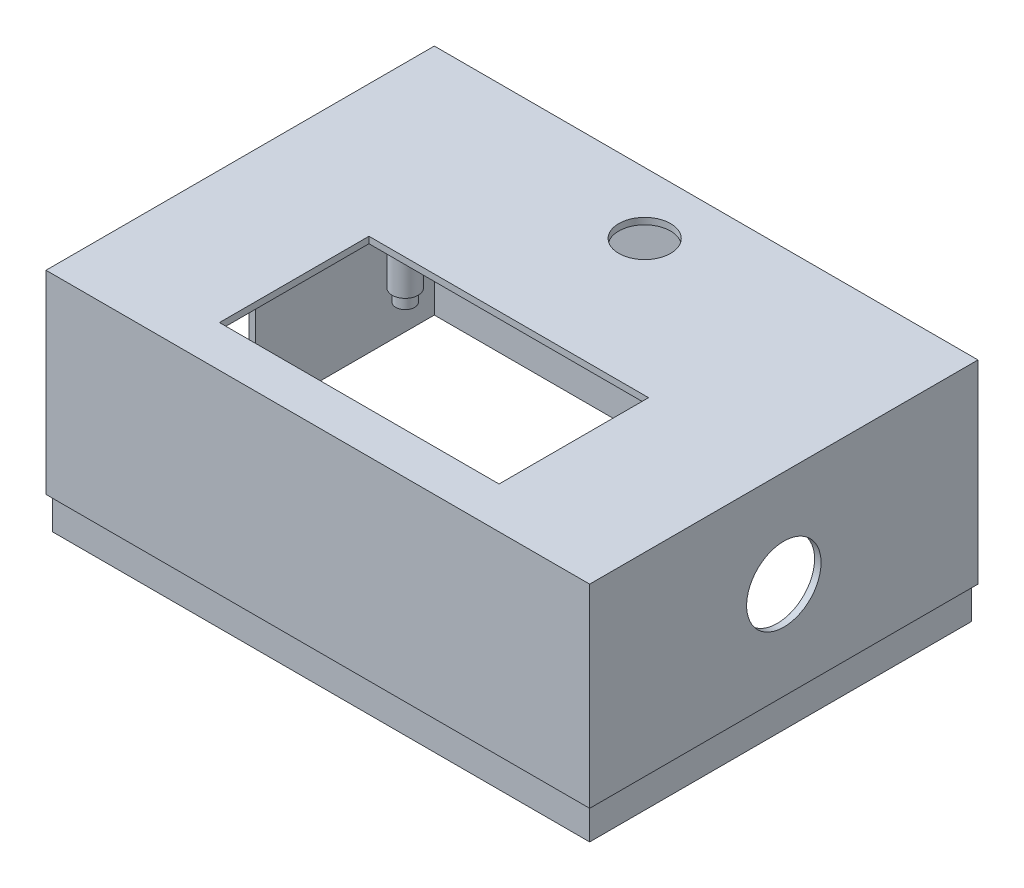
ISO-10303-21;
HEADER;
FILE_DESCRIPTION(('STEP AP214'),'2;1');
FILE_NAME('part.step','',(''),(''),'','','');
FILE_SCHEMA(('AUTOMOTIVE_DESIGN { 1 0 10303 214 1 1 1 1 }'));
ENDSEC;
DATA;
#1=APPLICATION_CONTEXT('core data for automotive mechanical design processes');
#2=APPLICATION_PROTOCOL_DEFINITION('international standard','automotive_design',2000,#1);
#3=PRODUCT_CONTEXT('',#1,'mechanical');
#4=PRODUCT('Part','Part','',(#3));
#5=PRODUCT_RELATED_PRODUCT_CATEGORY('part','',(#4));
#6=PRODUCT_DEFINITION_FORMATION('','',#4);
#7=PRODUCT_DEFINITION_CONTEXT('part definition',#1,'design');
#8=PRODUCT_DEFINITION('design','',#6,#7);
#9=PRODUCT_DEFINITION_SHAPE('','',#8);
#10=(LENGTH_UNIT() NAMED_UNIT(*) SI_UNIT(.MILLI.,.METRE.));
#11=(NAMED_UNIT(*) PLANE_ANGLE_UNIT() SI_UNIT($,.RADIAN.));
#12=(NAMED_UNIT(*) SI_UNIT($,.STERADIAN.) SOLID_ANGLE_UNIT());
#13=UNCERTAINTY_MEASURE_WITH_UNIT(LENGTH_MEASURE(1.E-05),#10,'distance_accuracy_value','');
#14=(GEOMETRIC_REPRESENTATION_CONTEXT(3) GLOBAL_UNCERTAINTY_ASSIGNED_CONTEXT((#13)) GLOBAL_UNIT_ASSIGNED_CONTEXT((#10,
#11,#12)) REPRESENTATION_CONTEXT('',''));
#15=CARTESIAN_POINT('',(0.,0.,0.));
#16=DIRECTION('',(0.,0.,1.));
#17=DIRECTION('',(1.,0.,0.));
#18=AXIS2_PLACEMENT_3D('',#15,#16,#17);
#19=CARTESIAN_POINT('',(0.,0.,0.));
#20=DIRECTION('',(0.,1.,0.));
#21=DIRECTION('',(0.,0.,1.));
#22=AXIS2_PLACEMENT_3D('',#19,#20,#21);
#23=PLANE('',#22);
#24=DIRECTION('',(1.,0.,0.));
#25=VECTOR('',#24,1.);
#26=CARTESIAN_POINT('',(0.,0.,-60.));
#27=LINE('',#26,#25);
#28=CARTESIAN_POINT('',(0.,0.,-60.));
#29=VERTEX_POINT('',#28);
#30=CARTESIAN_POINT('',(84.,0.,-60.));
#31=VERTEX_POINT('',#30);
#32=EDGE_CURVE('E386',#29,#31,#27,.T.);
#33=ORIENTED_EDGE('',*,*,#32,.T.);
#34=DIRECTION('',(0.,0.,-1.));
#35=VECTOR('',#34,1.);
#36=CARTESIAN_POINT('',(84.,0.,0.));
#37=LINE('',#36,#35);
#38=CARTESIAN_POINT('',(84.,0.,0.));
#39=VERTEX_POINT('',#38);
#40=EDGE_CURVE('E401',#39,#31,#37,.T.);
#41=ORIENTED_EDGE('',*,*,#40,.F.);
#42=DIRECTION('',(1.,0.,0.));
#43=VECTOR('',#42,1.);
#44=CARTESIAN_POINT('',(0.,0.,0.));
#45=LINE('',#44,#43);
#46=CARTESIAN_POINT('',(0.,0.,0.));
#47=VERTEX_POINT('',#46);
#48=EDGE_CURVE('E404',#47,#39,#45,.T.);
#49=ORIENTED_EDGE('',*,*,#48,.F.);
#50=DIRECTION('',(0.,0.,-1.));
#51=VECTOR('',#50,1.);
#52=CARTESIAN_POINT('',(0.,0.,0.));
#53=LINE('',#52,#51);
#54=EDGE_CURVE('E391',#47,#29,#53,.T.);
#55=ORIENTED_EDGE('',*,*,#54,.T.);
#56=EDGE_LOOP('',(#33,#41,#49,#55));
#57=FACE_BOUND('',#56,.T.);
#58=DIRECTION('',(0.,0.,-1.));
#59=VECTOR('',#58,1.);
#60=CARTESIAN_POINT('',(0.5,0.,-59.5));
#61=LINE('',#60,#59);
#62=CARTESIAN_POINT('',(0.5,0.,-0.5));
#63=VERTEX_POINT('',#62);
#64=CARTESIAN_POINT('',(0.5,0.,-59.5));
#65=VERTEX_POINT('',#64);
#66=EDGE_CURVE('E347',#63,#65,#61,.T.);
#67=ORIENTED_EDGE('',*,*,#66,.F.);
#68=DIRECTION('',(-1.,0.,0.));
#69=VECTOR('',#68,1.);
#70=CARTESIAN_POINT('',(0.5,0.,-0.5));
#71=LINE('',#70,#69);
#72=CARTESIAN_POINT('',(83.5,0.,-0.5));
#73=VERTEX_POINT('',#72);
#74=EDGE_CURVE('E358',#73,#63,#71,.T.);
#75=ORIENTED_EDGE('',*,*,#74,.F.);
#76=DIRECTION('',(0.,0.,1.));
#77=VECTOR('',#76,1.);
#78=CARTESIAN_POINT('',(83.5,0.,-59.5));
#79=LINE('',#78,#77);
#80=CARTESIAN_POINT('',(83.5,0.,-59.5));
#81=VERTEX_POINT('',#80);
#82=EDGE_CURVE('E370',#81,#73,#79,.T.);
#83=ORIENTED_EDGE('',*,*,#82,.F.);
#84=DIRECTION('',(1.,0.,0.));
#85=VECTOR('',#84,1.);
#86=CARTESIAN_POINT('',(0.5,0.,-59.5));
#87=LINE('',#86,#85);
#88=EDGE_CURVE('E367',#65,#81,#87,.T.);
#89=ORIENTED_EDGE('',*,*,#88,.F.);
#90=EDGE_LOOP('',(#67,#75,#83,#89));
#91=FACE_BOUND('',#90,.T.);
#92=ADVANCED_FACE('F36',(#57,#91),#23,.F.);
#93=CARTESIAN_POINT('',(0.,30.,-60.));
#94=DIRECTION('',(0.,0.,-1.));
#95=DIRECTION('',(-1.,0.,0.));
#96=AXIS2_PLACEMENT_3D('',#93,#94,#95);
#97=PLANE('',#96);
#98=ORIENTED_EDGE('',*,*,#32,.F.);
#99=DIRECTION('',(0.,-1.,0.));
#100=VECTOR('',#99,1.);
#101=CARTESIAN_POINT('',(0.,30.,-60.));
#102=LINE('',#101,#100);
#103=CARTESIAN_POINT('',(0.,30.,-60.));
#104=VERTEX_POINT('',#103);
#105=EDGE_CURVE('E408',#104,#29,#102,.T.);
#106=ORIENTED_EDGE('',*,*,#105,.F.);
#107=DIRECTION('',(1.,0.,0.));
#108=VECTOR('',#107,1.);
#109=CARTESIAN_POINT('',(0.,30.,-60.));
#110=LINE('',#109,#108);
#111=CARTESIAN_POINT('',(84.,30.,-60.));
#112=VERTEX_POINT('',#111);
#113=EDGE_CURVE('E387',#104,#112,#110,.T.);
#114=ORIENTED_EDGE('',*,*,#113,.T.);
#115=DIRECTION('',(0.,-1.,0.));
#116=VECTOR('',#115,1.);
#117=CARTESIAN_POINT('',(84.,30.,-60.));
#118=LINE('',#117,#116);
#119=EDGE_CURVE('E398',#112,#31,#118,.T.);
#120=ORIENTED_EDGE('',*,*,#119,.T.);
#121=EDGE_LOOP('',(#98,#106,#114,#120));
#122=FACE_BOUND('',#121,.T.);
#123=ADVANCED_FACE('F38',(#122),#97,.T.);
#124=CARTESIAN_POINT('',(0.,30.,0.));
#125=DIRECTION('',(-1.,0.,0.));
#126=DIRECTION('',(0.,0.,1.));
#127=AXIS2_PLACEMENT_3D('',#124,#125,#126);
#128=PLANE('',#127);
#129=DIRECTION('',(0.,-1.,0.));
#130=VECTOR('',#129,1.);
#131=CARTESIAN_POINT('',(0.,1.9,-31.4));
#132=LINE('',#131,#130);
#133=CARTESIAN_POINT('',(0.,9.9,-31.4));
#134=VERTEX_POINT('',#133);
#135=CARTESIAN_POINT('',(0.,1.9,-31.4));
#136=VERTEX_POINT('',#135);
#137=EDGE_CURVE('E53',#134,#136,#132,.T.);
#138=ORIENTED_EDGE('',*,*,#137,.F.);
#139=DIRECTION('',(0.,0.,-1.));
#140=VECTOR('',#139,1.);
#141=CARTESIAN_POINT('',(0.,9.9,-31.4));
#142=LINE('',#141,#140);
#143=CARTESIAN_POINT('',(0.,9.9,-18.4));
#144=VERTEX_POINT('',#143);
#145=EDGE_CURVE('E205',#144,#134,#142,.T.);
#146=ORIENTED_EDGE('',*,*,#145,.F.);
#147=DIRECTION('',(0.,1.,0.));
#148=VECTOR('',#147,1.);
#149=CARTESIAN_POINT('',(0.,1.9,-18.4));
#150=LINE('',#149,#148);
#151=CARTESIAN_POINT('',(0.,1.9,-18.4));
#152=VERTEX_POINT('',#151);
#153=EDGE_CURVE('E208',#152,#144,#150,.T.);
#154=ORIENTED_EDGE('',*,*,#153,.F.);
#155=DIRECTION('',(0.,0.,1.));
#156=VECTOR('',#155,1.);
#157=CARTESIAN_POINT('',(0.,1.9,-31.4));
#158=LINE('',#157,#156);
#159=EDGE_CURVE('E217',#136,#152,#158,.T.);
#160=ORIENTED_EDGE('',*,*,#159,.F.);
#161=EDGE_LOOP('',(#138,#146,#154,#160));
#162=FACE_BOUND('',#161,.T.);
#163=ORIENTED_EDGE('',*,*,#54,.F.);
#164=DIRECTION('',(0.,-1.,0.));
#165=VECTOR('',#164,1.);
#166=CARTESIAN_POINT('',(0.,30.,0.));
#167=LINE('',#166,#165);
#168=CARTESIAN_POINT('',(0.,30.,0.));
#169=VERTEX_POINT('',#168);
#170=EDGE_CURVE('E411',#169,#47,#167,.T.);
#171=ORIENTED_EDGE('',*,*,#170,.F.);
#172=DIRECTION('',(0.,0.,-1.));
#173=VECTOR('',#172,1.);
#174=CARTESIAN_POINT('',(0.,30.,0.));
#175=LINE('',#174,#173);
#176=EDGE_CURVE('E395',#169,#104,#175,.T.);
#177=ORIENTED_EDGE('',*,*,#176,.T.);
#178=ORIENTED_EDGE('',*,*,#105,.T.);
#179=EDGE_LOOP('',(#163,#171,#177,#178));
#180=FACE_BOUND('',#179,.T.);
#181=ADVANCED_FACE('F485',(#162,#180),#128,.T.);
#182=CARTESIAN_POINT('',(0.,30.,0.));
#183=DIRECTION('',(0.,0.,-1.));
#184=DIRECTION('',(-1.,0.,0.));
#185=AXIS2_PLACEMENT_3D('',#182,#183,#184);
#186=PLANE('',#185);
#187=ORIENTED_EDGE('',*,*,#48,.T.);
#188=DIRECTION('',(0.,-1.,0.));
#189=VECTOR('',#188,1.);
#190=CARTESIAN_POINT('',(84.,30.,0.));
#191=LINE('',#190,#189);
#192=CARTESIAN_POINT('',(84.,30.,0.));
#193=VERTEX_POINT('',#192);
#194=EDGE_CURVE('E413',#193,#39,#191,.T.);
#195=ORIENTED_EDGE('',*,*,#194,.F.);
#196=DIRECTION('',(1.,0.,0.));
#197=VECTOR('',#196,1.);
#198=CARTESIAN_POINT('',(0.,30.,0.));
#199=LINE('',#198,#197);
#200=EDGE_CURVE('E393',#169,#193,#199,.T.);
#201=ORIENTED_EDGE('',*,*,#200,.F.);
#202=ORIENTED_EDGE('',*,*,#170,.T.);
#203=EDGE_LOOP('',(#187,#195,#201,#202));
#204=FACE_BOUND('',#203,.T.);
#205=ADVANCED_FACE('F493',(#204),#186,.F.);
#206=CARTESIAN_POINT('',(84.,30.,0.));
#207=DIRECTION('',(-1.,0.,0.));
#208=DIRECTION('',(0.,0.,1.));
#209=AXIS2_PLACEMENT_3D('',#206,#207,#208);
#210=PLANE('',#209);
#211=CARTESIAN_POINT('',(84.,15.,-30.));
#212=DIRECTION('',(1.,0.,0.));
#213=DIRECTION('',(0.,0.,-1.));
#214=AXIS2_PLACEMENT_3D('',#211,#212,#213);
#215=CIRCLE('',#214,5.75);
#216=CARTESIAN_POINT('',(84.,15.,-35.75));
#217=VERTEX_POINT('',#216);
#218=EDGE_CURVE('E211',#217,#217,#215,.T.);
#219=ORIENTED_EDGE('',*,*,#218,.F.);
#220=EDGE_LOOP('',(#219));
#221=FACE_BOUND('',#220,.T.);
#222=ORIENTED_EDGE('',*,*,#40,.T.);
#223=ORIENTED_EDGE('',*,*,#119,.F.);
#224=DIRECTION('',(0.,0.,-1.));
#225=VECTOR('',#224,1.);
#226=CARTESIAN_POINT('',(84.,30.,0.));
#227=LINE('',#226,#225);
#228=EDGE_CURVE('E390',#193,#112,#227,.T.);
#229=ORIENTED_EDGE('',*,*,#228,.F.);
#230=ORIENTED_EDGE('',*,*,#194,.T.);
#231=EDGE_LOOP('',(#222,#223,#229,#230));
#232=FACE_BOUND('',#231,.T.);
#233=ADVANCED_FACE('F496',(#221,#232),#210,.F.);
#234=CARTESIAN_POINT('',(0.,30.,0.));
#235=DIRECTION('',(0.,1.,0.));
#236=DIRECTION('',(0.,0.,1.));
#237=AXIS2_PLACEMENT_3D('',#234,#235,#236);
#238=PLANE('',#237);
#239=CARTESIAN_POINT('',(42.,30.,-50.5));
#240=DIRECTION('',(0.,1.,0.));
#241=DIRECTION('',(0.,0.,1.));
#242=AXIS2_PLACEMENT_3D('',#239,#240,#241);
#243=CIRCLE('',#242,4.);
#244=CARTESIAN_POINT('',(42.,30.,-46.5));
#245=VERTEX_POINT('',#244);
#246=EDGE_CURVE('E283',#245,#245,#243,.T.);
#247=ORIENTED_EDGE('',*,*,#246,.F.);
#248=EDGE_LOOP('',(#247));
#249=FACE_BOUND('',#248,.T.);
#250=DIRECTION('',(0.,0.,-1.));
#251=VECTOR('',#250,1.);
#252=CARTESIAN_POINT('',(63.6,30.,-29.5));
#253=LINE('',#252,#251);
#254=CARTESIAN_POINT('',(63.6,30.,-6.4));
#255=VERTEX_POINT('',#254);
#256=CARTESIAN_POINT('',(63.6,30.,-29.5));
#257=VERTEX_POINT('',#256);
#258=EDGE_CURVE('E287',#255,#257,#253,.T.);
#259=ORIENTED_EDGE('',*,*,#258,.F.);
#260=DIRECTION('',(1.,0.,0.));
#261=VECTOR('',#260,1.);
#262=CARTESIAN_POINT('',(63.6,30.,-6.4));
#263=LINE('',#262,#261);
#264=CARTESIAN_POINT('',(20.4,30.,-6.39999999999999));
#265=VERTEX_POINT('',#264);
#266=EDGE_CURVE('E294',#265,#255,#263,.T.);
#267=ORIENTED_EDGE('',*,*,#266,.F.);
#268=DIRECTION('',(0.,0.,1.));
#269=VECTOR('',#268,1.);
#270=CARTESIAN_POINT('',(20.4,30.,-29.5));
#271=LINE('',#270,#269);
#272=CARTESIAN_POINT('',(20.4,30.,-29.5));
#273=VERTEX_POINT('',#272);
#274=EDGE_CURVE('E308',#273,#265,#271,.T.);
#275=ORIENTED_EDGE('',*,*,#274,.F.);
#276=DIRECTION('',(-1.,0.,0.));
#277=VECTOR('',#276,1.);
#278=CARTESIAN_POINT('',(63.6,30.,-29.5));
#279=LINE('',#278,#277);
#280=EDGE_CURVE('E305',#257,#273,#279,.T.);
#281=ORIENTED_EDGE('',*,*,#280,.F.);
#282=EDGE_LOOP('',(#259,#267,#275,#281));
#283=FACE_BOUND('',#282,.T.);
#284=ORIENTED_EDGE('',*,*,#113,.F.);
#285=ORIENTED_EDGE('',*,*,#176,.F.);
#286=ORIENTED_EDGE('',*,*,#200,.T.);
#287=ORIENTED_EDGE('',*,*,#228,.T.);
#288=EDGE_LOOP('',(#284,#285,#286,#287));
#289=FACE_BOUND('',#288,.T.);
#290=ADVANCED_FACE('F489',(#249,#283,#289),#238,.T.);
#291=CARTESIAN_POINT('',(0.5,-5.,-59.5));
#292=DIRECTION('',(1.,0.,0.));
#293=DIRECTION('',(0.,0.,-1.));
#294=AXIS2_PLACEMENT_3D('',#291,#292,#293);
#295=PLANE('',#294);
#296=ORIENTED_EDGE('',*,*,#66,.T.);
#297=DIRECTION('',(0.,1.,0.));
#298=VECTOR('',#297,1.);
#299=CARTESIAN_POINT('',(0.5,-5.,-59.5));
#300=LINE('',#299,#298);
#301=CARTESIAN_POINT('',(0.5,-5.,-59.5));
#302=VERTEX_POINT('',#301);
#303=EDGE_CURVE('E383',#302,#65,#300,.T.);
#304=ORIENTED_EDGE('',*,*,#303,.F.);
#305=DIRECTION('',(0.,0.,-1.));
#306=VECTOR('',#305,1.);
#307=CARTESIAN_POINT('',(0.5,-5.,-59.5));
#308=LINE('',#307,#306);
#309=CARTESIAN_POINT('',(0.5,-5.,-0.5));
#310=VERTEX_POINT('',#309);
#311=EDGE_CURVE('E354',#310,#302,#308,.T.);
#312=ORIENTED_EDGE('',*,*,#311,.F.);
#313=DIRECTION('',(0.,1.,0.));
#314=VECTOR('',#313,1.);
#315=CARTESIAN_POINT('',(0.5,-5.,-0.5));
#316=LINE('',#315,#314);
#317=EDGE_CURVE('E364',#310,#63,#316,.T.);
#318=ORIENTED_EDGE('',*,*,#317,.T.);
#319=EDGE_LOOP('',(#296,#304,#312,#318));
#320=FACE_BOUND('',#319,.T.);
#321=ADVANCED_FACE('F470',(#320),#295,.F.);
#322=CARTESIAN_POINT('',(0.5,-5.,-59.5));
#323=DIRECTION('',(0.,0.,1.));
#324=DIRECTION('',(1.,0.,0.));
#325=AXIS2_PLACEMENT_3D('',#322,#323,#324);
#326=PLANE('',#325);
#327=ORIENTED_EDGE('',*,*,#88,.T.);
#328=DIRECTION('',(0.,1.,0.));
#329=VECTOR('',#328,1.);
#330=CARTESIAN_POINT('',(83.5,-5.,-59.5));
#331=LINE('',#330,#329);
#332=CARTESIAN_POINT('',(83.5,-5.,-59.5));
#333=VERTEX_POINT('',#332);
#334=EDGE_CURVE('E380',#333,#81,#331,.T.);
#335=ORIENTED_EDGE('',*,*,#334,.F.);
#336=DIRECTION('',(1.,0.,0.));
#337=VECTOR('',#336,1.);
#338=CARTESIAN_POINT('',(0.5,-5.,-59.5));
#339=LINE('',#338,#337);
#340=EDGE_CURVE('E357',#302,#333,#339,.T.);
#341=ORIENTED_EDGE('',*,*,#340,.F.);
#342=ORIENTED_EDGE('',*,*,#303,.T.);
#343=EDGE_LOOP('',(#327,#335,#341,#342));
#344=FACE_BOUND('',#343,.T.);
#345=ADVANCED_FACE('F472',(#344),#326,.F.);
#346=CARTESIAN_POINT('',(83.5,-5.,-59.5));
#347=DIRECTION('',(-1.,0.,0.));
#348=DIRECTION('',(0.,0.,1.));
#349=AXIS2_PLACEMENT_3D('',#346,#347,#348);
#350=PLANE('',#349);
#351=ORIENTED_EDGE('',*,*,#82,.T.);
#352=DIRECTION('',(0.,1.,0.));
#353=VECTOR('',#352,1.);
#354=CARTESIAN_POINT('',(83.5,-5.,-0.5));
#355=LINE('',#354,#353);
#356=CARTESIAN_POINT('',(83.5,-5.,-0.5));
#357=VERTEX_POINT('',#356);
#358=EDGE_CURVE('E377',#357,#73,#355,.T.);
#359=ORIENTED_EDGE('',*,*,#358,.F.);
#360=DIRECTION('',(0.,0.,1.));
#361=VECTOR('',#360,1.);
#362=CARTESIAN_POINT('',(83.5,-5.,-59.5));
#363=LINE('',#362,#361);
#364=EDGE_CURVE('E360',#333,#357,#363,.T.);
#365=ORIENTED_EDGE('',*,*,#364,.F.);
#366=ORIENTED_EDGE('',*,*,#334,.T.);
#367=EDGE_LOOP('',(#351,#359,#365,#366));
#368=FACE_BOUND('',#367,.T.);
#369=ADVANCED_FACE('F476',(#368),#350,.F.);
#370=CARTESIAN_POINT('',(0.5,-5.,-0.5));
#371=DIRECTION('',(0.,0.,-1.));
#372=DIRECTION('',(-1.,0.,0.));
#373=AXIS2_PLACEMENT_3D('',#370,#371,#372);
#374=PLANE('',#373);
#375=ORIENTED_EDGE('',*,*,#74,.T.);
#376=ORIENTED_EDGE('',*,*,#317,.F.);
#377=DIRECTION('',(-1.,0.,0.));
#378=VECTOR('',#377,1.);
#379=CARTESIAN_POINT('',(0.5,-5.,-0.5));
#380=LINE('',#379,#378);
#381=EDGE_CURVE('E362',#357,#310,#380,.T.);
#382=ORIENTED_EDGE('',*,*,#381,.F.);
#383=ORIENTED_EDGE('',*,*,#358,.T.);
#384=EDGE_LOOP('',(#375,#376,#382,#383));
#385=FACE_BOUND('',#384,.T.);
#386=ADVANCED_FACE('F462',(#385),#374,.F.);
#387=CARTESIAN_POINT('',(0.,-5.,0.));
#388=DIRECTION('',(0.,1.,0.));
#389=DIRECTION('',(0.,0.,1.));
#390=AXIS2_PLACEMENT_3D('',#387,#388,#389);
#391=PLANE('',#390);
#392=DIRECTION('',(1.,0.,0.));
#393=VECTOR('',#392,1.);
#394=CARTESIAN_POINT('',(1.,-5.,-59.));
#395=LINE('',#394,#393);
#396=CARTESIAN_POINT('',(1.,-5.,-59.));
#397=VERTEX_POINT('',#396);
#398=CARTESIAN_POINT('',(83.,-5.,-59.));
#399=VERTEX_POINT('',#398);
#400=EDGE_CURVE('E337',#397,#399,#395,.T.);
#401=ORIENTED_EDGE('',*,*,#400,.F.);
#402=DIRECTION('',(0.,0.,-1.));
#403=VECTOR('',#402,1.);
#404=CARTESIAN_POINT('',(1.,-5.,-59.));
#405=LINE('',#404,#403);
#406=CARTESIAN_POINT('',(1.,-5.,-0.999999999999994));
#407=VERTEX_POINT('',#406);
#408=EDGE_CURVE('E315',#407,#397,#405,.T.);
#409=ORIENTED_EDGE('',*,*,#408,.F.);
#410=DIRECTION('',(-1.,0.,0.));
#411=VECTOR('',#410,1.);
#412=CARTESIAN_POINT('',(1.,-5.,-0.999999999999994));
#413=LINE('',#412,#411);
#414=CARTESIAN_POINT('',(83.,-5.,-0.999999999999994));
#415=VERTEX_POINT('',#414);
#416=EDGE_CURVE('E326',#415,#407,#413,.T.);
#417=ORIENTED_EDGE('',*,*,#416,.F.);
#418=DIRECTION('',(0.,0.,1.));
#419=VECTOR('',#418,1.);
#420=CARTESIAN_POINT('',(83.,-5.,-59.));
#421=LINE('',#420,#419);
#422=EDGE_CURVE('E340',#399,#415,#421,.T.);
#423=ORIENTED_EDGE('',*,*,#422,.F.);
#424=EDGE_LOOP('',(#401,#409,#417,#423));
#425=FACE_BOUND('',#424,.T.);
#426=ORIENTED_EDGE('',*,*,#311,.T.);
#427=ORIENTED_EDGE('',*,*,#340,.T.);
#428=ORIENTED_EDGE('',*,*,#364,.T.);
#429=ORIENTED_EDGE('',*,*,#381,.T.);
#430=EDGE_LOOP('',(#426,#427,#428,#429));
#431=FACE_BOUND('',#430,.T.);
#432=ADVANCED_FACE('F459',(#425,#431),#391,.F.);
#433=CARTESIAN_POINT('',(1.,29.,-59.));
#434=DIRECTION('',(-1.,0.,0.));
#435=DIRECTION('',(0.,0.,1.));
#436=AXIS2_PLACEMENT_3D('',#433,#434,#435);
#437=PLANE('',#436);
#438=DIRECTION('',(0.,0.,-1.));
#439=VECTOR('',#438,1.);
#440=CARTESIAN_POINT('',(1.,9.9,-31.4));
#441=LINE('',#440,#439);
#442=CARTESIAN_POINT('',(1.,9.9,-18.4));
#443=VERTEX_POINT('',#442);
#444=CARTESIAN_POINT('',(1.,9.9,-31.4));
#445=VERTEX_POINT('',#444);
#446=EDGE_CURVE('E195',#443,#445,#441,.T.);
#447=ORIENTED_EDGE('',*,*,#446,.T.);
#448=DIRECTION('',(0.,-1.,0.));
#449=VECTOR('',#448,1.);
#450=CARTESIAN_POINT('',(1.,1.9,-31.4));
#451=LINE('',#450,#449);
#452=CARTESIAN_POINT('',(1.,1.9,-31.4));
#453=VERTEX_POINT('',#452);
#454=EDGE_CURVE('E189',#445,#453,#451,.T.);
#455=ORIENTED_EDGE('',*,*,#454,.T.);
#456=DIRECTION('',(0.,0.,1.));
#457=VECTOR('',#456,1.);
#458=CARTESIAN_POINT('',(1.,1.9,-31.4));
#459=LINE('',#458,#457);
#460=CARTESIAN_POINT('',(1.,1.9,-18.4));
#461=VERTEX_POINT('',#460);
#462=EDGE_CURVE('E198',#453,#461,#459,.T.);
#463=ORIENTED_EDGE('',*,*,#462,.T.);
#464=DIRECTION('',(0.,1.,0.));
#465=VECTOR('',#464,1.);
#466=CARTESIAN_POINT('',(1.,1.9,-18.4));
#467=LINE('',#466,#465);
#468=EDGE_CURVE('E61',#461,#443,#467,.T.);
#469=ORIENTED_EDGE('',*,*,#468,.T.);
#470=EDGE_LOOP('',(#447,#455,#463,#469));
#471=FACE_BOUND('',#470,.T.);
#472=ORIENTED_EDGE('',*,*,#408,.T.);
#473=DIRECTION('',(0.,-1.,0.));
#474=VECTOR('',#473,1.);
#475=CARTESIAN_POINT('',(1.,29.,-59.));
#476=LINE('',#475,#474);
#477=CARTESIAN_POINT('',(1.,29.,-59.));
#478=VERTEX_POINT('',#477);
#479=EDGE_CURVE('E335',#478,#397,#476,.T.);
#480=ORIENTED_EDGE('',*,*,#479,.F.);
#481=DIRECTION('',(0.,0.,-1.));
#482=VECTOR('',#481,1.);
#483=CARTESIAN_POINT('',(1.,29.,-59.));
#484=LINE('',#483,#482);
#485=CARTESIAN_POINT('',(1.,29.,-0.999999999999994));
#486=VERTEX_POINT('',#485);
#487=EDGE_CURVE('E322',#486,#478,#484,.T.);
#488=ORIENTED_EDGE('',*,*,#487,.F.);
#489=DIRECTION('',(0.,-1.,0.));
#490=VECTOR('',#489,1.);
#491=CARTESIAN_POINT('',(1.,29.,-0.999999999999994));
#492=LINE('',#491,#490);
#493=EDGE_CURVE('E345',#486,#407,#492,.T.);
#494=ORIENTED_EDGE('',*,*,#493,.T.);
#495=EDGE_LOOP('',(#472,#480,#488,#494));
#496=FACE_BOUND('',#495,.T.);
#497=ADVANCED_FACE('F202',(#471,#496),#437,.F.);
#498=CARTESIAN_POINT('',(1.,29.,-0.999999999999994));
#499=DIRECTION('',(0.,0.,1.));
#500=DIRECTION('',(1.,0.,0.));
#501=AXIS2_PLACEMENT_3D('',#498,#499,#500);
#502=PLANE('',#501);
#503=ORIENTED_EDGE('',*,*,#416,.T.);
#504=ORIENTED_EDGE('',*,*,#493,.F.);
#505=DIRECTION('',(-1.,0.,0.));
#506=VECTOR('',#505,1.);
#507=CARTESIAN_POINT('',(1.,29.,-0.999999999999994));
#508=LINE('',#507,#506);
#509=CARTESIAN_POINT('',(83.,29.,-0.999999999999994));
#510=VERTEX_POINT('',#509);
#511=EDGE_CURVE('E332',#510,#486,#508,.T.);
#512=ORIENTED_EDGE('',*,*,#511,.F.);
#513=DIRECTION('',(0.,-1.,0.));
#514=VECTOR('',#513,1.);
#515=CARTESIAN_POINT('',(83.,29.,-0.999999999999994));
#516=LINE('',#515,#514);
#517=EDGE_CURVE('E348',#510,#415,#516,.T.);
#518=ORIENTED_EDGE('',*,*,#517,.T.);
#519=EDGE_LOOP('',(#503,#504,#512,#518));
#520=FACE_BOUND('',#519,.T.);
#521=ADVANCED_FACE('F456',(#520),#502,.F.);
#522=CARTESIAN_POINT('',(83.,29.,-59.));
#523=DIRECTION('',(1.,0.,0.));
#524=DIRECTION('',(0.,0.,-1.));
#525=AXIS2_PLACEMENT_3D('',#522,#523,#524);
#526=PLANE('',#525);
#527=CARTESIAN_POINT('',(83.,15.,-30.));
#528=DIRECTION('',(1.,0.,0.));
#529=DIRECTION('',(0.,0.,-1.));
#530=AXIS2_PLACEMENT_3D('',#527,#528,#529);
#531=CIRCLE('',#530,5.75);
#532=CARTESIAN_POINT('',(83.,15.,-35.75));
#533=VERTEX_POINT('',#532);
#534=EDGE_CURVE('E218',#533,#533,#531,.T.);
#535=ORIENTED_EDGE('',*,*,#534,.T.);
#536=EDGE_LOOP('',(#535));
#537=FACE_BOUND('',#536,.T.);
#538=ORIENTED_EDGE('',*,*,#422,.T.);
#539=ORIENTED_EDGE('',*,*,#517,.F.);
#540=DIRECTION('',(0.,0.,1.));
#541=VECTOR('',#540,1.);
#542=CARTESIAN_POINT('',(83.,29.,-59.));
#543=LINE('',#542,#541);
#544=CARTESIAN_POINT('',(83.,29.,-59.));
#545=VERTEX_POINT('',#544);
#546=EDGE_CURVE('E329',#545,#510,#543,.T.);
#547=ORIENTED_EDGE('',*,*,#546,.F.);
#548=DIRECTION('',(0.,-1.,0.));
#549=VECTOR('',#548,1.);
#550=CARTESIAN_POINT('',(83.,29.,-59.));
#551=LINE('',#550,#549);
#552=EDGE_CURVE('E350',#545,#399,#551,.T.);
#553=ORIENTED_EDGE('',*,*,#552,.T.);
#554=EDGE_LOOP('',(#538,#539,#547,#553));
#555=FACE_BOUND('',#554,.T.);
#556=ADVANCED_FACE('F454',(#537,#555),#526,.F.);
#557=CARTESIAN_POINT('',(1.,29.,-59.));
#558=DIRECTION('',(0.,0.,-1.));
#559=DIRECTION('',(-1.,0.,0.));
#560=AXIS2_PLACEMENT_3D('',#557,#558,#559);
#561=PLANE('',#560);
#562=ORIENTED_EDGE('',*,*,#400,.T.);
#563=ORIENTED_EDGE('',*,*,#552,.F.);
#564=DIRECTION('',(1.,0.,0.));
#565=VECTOR('',#564,1.);
#566=CARTESIAN_POINT('',(1.,29.,-59.));
#567=LINE('',#566,#565);
#568=EDGE_CURVE('E325',#478,#545,#567,.T.);
#569=ORIENTED_EDGE('',*,*,#568,.F.);
#570=ORIENTED_EDGE('',*,*,#479,.T.);
#571=EDGE_LOOP('',(#562,#563,#569,#570));
#572=FACE_BOUND('',#571,.T.);
#573=ADVANCED_FACE('F434',(#572),#561,.F.);
#574=CARTESIAN_POINT('',(0.,29.,0.));
#575=DIRECTION('',(0.,1.,0.));
#576=DIRECTION('',(0.,0.,1.));
#577=AXIS2_PLACEMENT_3D('',#574,#575,#576);
#578=PLANE('',#577);
#579=CARTESIAN_POINT('',(75.,29.,-49.5));
#580=DIRECTION('',(0.,1.,0.));
#581=DIRECTION('',(0.,0.,1.));
#582=AXIS2_PLACEMENT_3D('',#579,#580,#581);
#583=CIRCLE('',#582,2.);
#584=CARTESIAN_POINT('',(75.,29.,-47.5));
#585=VERTEX_POINT('',#584);
#586=EDGE_CURVE('E40',#585,#585,#583,.F.);
#587=ORIENTED_EDGE('',*,*,#586,.F.);
#588=EDGE_LOOP('',(#587));
#589=FACE_BOUND('',#588,.T.);
#590=CARTESIAN_POINT('',(75.,29.,-11.));
#591=DIRECTION('',(0.,1.,0.));
#592=DIRECTION('',(0.,0.,1.));
#593=AXIS2_PLACEMENT_3D('',#590,#591,#592);
#594=CIRCLE('',#593,2.);
#595=CARTESIAN_POINT('',(75.,29.,-9.));
#596=VERTEX_POINT('',#595);
#597=EDGE_CURVE('E421',#596,#596,#594,.F.);
#598=ORIENTED_EDGE('',*,*,#597,.F.);
#599=EDGE_LOOP('',(#598));
#600=FACE_BOUND('',#599,.T.);
#601=CARTESIAN_POINT('',(6.,29.,-11.));
#602=DIRECTION('',(0.,1.,0.));
#603=DIRECTION('',(0.,0.,1.));
#604=AXIS2_PLACEMENT_3D('',#601,#602,#603);
#605=CIRCLE('',#604,2.);
#606=CARTESIAN_POINT('',(6.,29.,-9.));
#607=VERTEX_POINT('',#606);
#608=EDGE_CURVE('E419',#607,#607,#605,.F.);
#609=ORIENTED_EDGE('',*,*,#608,.F.);
#610=EDGE_LOOP('',(#609));
#611=FACE_BOUND('',#610,.T.);
#612=CARTESIAN_POINT('',(6.,29.,-49.5));
#613=DIRECTION('',(0.,1.,0.));
#614=DIRECTION('',(0.,0.,1.));
#615=AXIS2_PLACEMENT_3D('',#612,#613,#614);
#616=CIRCLE('',#615,2.);
#617=CARTESIAN_POINT('',(6.,29.,-47.5));
#618=VERTEX_POINT('',#617);
#619=EDGE_CURVE('E410',#618,#618,#616,.F.);
#620=ORIENTED_EDGE('',*,*,#619,.F.);
#621=EDGE_LOOP('',(#620));
#622=FACE_BOUND('',#621,.T.);
#623=CARTESIAN_POINT('',(42.,29.,-50.5));
#624=DIRECTION('',(0.,1.,0.));
#625=DIRECTION('',(0.,0.,1.));
#626=AXIS2_PLACEMENT_3D('',#623,#624,#625);
#627=CIRCLE('',#626,4.);
#628=CARTESIAN_POINT('',(42.,29.,-46.5));
#629=VERTEX_POINT('',#628);
#630=EDGE_CURVE('E284',#629,#629,#627,.T.);
#631=ORIENTED_EDGE('',*,*,#630,.T.);
#632=EDGE_LOOP('',(#631));
#633=FACE_BOUND('',#632,.T.);
#634=DIRECTION('',(1.,0.,0.));
#635=VECTOR('',#634,1.);
#636=CARTESIAN_POINT('',(63.6,29.,-6.4));
#637=LINE('',#636,#635);
#638=CARTESIAN_POINT('',(20.4,29.,-6.39999999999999));
#639=VERTEX_POINT('',#638);
#640=CARTESIAN_POINT('',(63.6,29.,-6.4));
#641=VERTEX_POINT('',#640);
#642=EDGE_CURVE('E300',#639,#641,#637,.T.);
#643=ORIENTED_EDGE('',*,*,#642,.T.);
#644=DIRECTION('',(0.,0.,-1.));
#645=VECTOR('',#644,1.);
#646=CARTESIAN_POINT('',(63.6,29.,-29.5));
#647=LINE('',#646,#645);
#648=CARTESIAN_POINT('',(63.6,29.,-29.5));
#649=VERTEX_POINT('',#648);
#650=EDGE_CURVE('E290',#641,#649,#647,.T.);
#651=ORIENTED_EDGE('',*,*,#650,.T.);
#652=DIRECTION('',(-1.,0.,0.));
#653=VECTOR('',#652,1.);
#654=CARTESIAN_POINT('',(63.6,29.,-29.5));
#655=LINE('',#654,#653);
#656=CARTESIAN_POINT('',(20.4,29.,-29.5));
#657=VERTEX_POINT('',#656);
#658=EDGE_CURVE('E293',#649,#657,#655,.T.);
#659=ORIENTED_EDGE('',*,*,#658,.T.);
#660=DIRECTION('',(0.,0.,1.));
#661=VECTOR('',#660,1.);
#662=CARTESIAN_POINT('',(20.4,29.,-29.5));
#663=LINE('',#662,#661);
#664=EDGE_CURVE('E297',#657,#639,#663,.T.);
#665=ORIENTED_EDGE('',*,*,#664,.T.);
#666=EDGE_LOOP('',(#643,#651,#659,#665));
#667=FACE_BOUND('',#666,.T.);
#668=ORIENTED_EDGE('',*,*,#487,.T.);
#669=ORIENTED_EDGE('',*,*,#568,.T.);
#670=ORIENTED_EDGE('',*,*,#546,.T.);
#671=ORIENTED_EDGE('',*,*,#511,.T.);
#672=EDGE_LOOP('',(#668,#669,#670,#671));
#673=FACE_BOUND('',#672,.T.);
#674=ADVANCED_FACE('F430',(#589,#600,#611,#622,#633,#667,#673),#578,.F.);
#675=CARTESIAN_POINT('',(63.6,29.,-29.5));
#676=DIRECTION('',(1.,0.,0.));
#677=DIRECTION('',(0.,0.,-1.));
#678=AXIS2_PLACEMENT_3D('',#675,#676,#677);
#679=PLANE('',#678);
#680=ORIENTED_EDGE('',*,*,#258,.T.);
#681=DIRECTION('',(0.,1.,0.));
#682=VECTOR('',#681,1.);
#683=CARTESIAN_POINT('',(63.6,29.,-29.5));
#684=LINE('',#683,#682);
#685=EDGE_CURVE('E303',#649,#257,#684,.T.);
#686=ORIENTED_EDGE('',*,*,#685,.F.);
#687=ORIENTED_EDGE('',*,*,#650,.F.);
#688=DIRECTION('',(0.,1.,0.));
#689=VECTOR('',#688,1.);
#690=CARTESIAN_POINT('',(63.6,29.,-6.4));
#691=LINE('',#690,#689);
#692=EDGE_CURVE('E313',#641,#255,#691,.T.);
#693=ORIENTED_EDGE('',*,*,#692,.T.);
#694=EDGE_LOOP('',(#680,#686,#687,#693));
#695=FACE_BOUND('',#694,.T.);
#696=ADVANCED_FACE('F433',(#695),#679,.F.);
#697=CARTESIAN_POINT('',(63.6,29.,-6.4));
#698=DIRECTION('',(0.,0.,1.));
#699=DIRECTION('',(1.,0.,0.));
#700=AXIS2_PLACEMENT_3D('',#697,#698,#699);
#701=PLANE('',#700);
#702=ORIENTED_EDGE('',*,*,#266,.T.);
#703=ORIENTED_EDGE('',*,*,#692,.F.);
#704=ORIENTED_EDGE('',*,*,#642,.F.);
#705=DIRECTION('',(0.,1.,0.));
#706=VECTOR('',#705,1.);
#707=CARTESIAN_POINT('',(20.4,29.,-6.39999999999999));
#708=LINE('',#707,#706);
#709=EDGE_CURVE('E316',#639,#265,#708,.T.);
#710=ORIENTED_EDGE('',*,*,#709,.T.);
#711=EDGE_LOOP('',(#702,#703,#704,#710));
#712=FACE_BOUND('',#711,.T.);
#713=ADVANCED_FACE('F641',(#712),#701,.F.);
#714=CARTESIAN_POINT('',(20.4,29.,-29.5));
#715=DIRECTION('',(-1.,0.,0.));
#716=DIRECTION('',(0.,0.,1.));
#717=AXIS2_PLACEMENT_3D('',#714,#715,#716);
#718=PLANE('',#717);
#719=ORIENTED_EDGE('',*,*,#274,.T.);
#720=ORIENTED_EDGE('',*,*,#709,.F.);
#721=ORIENTED_EDGE('',*,*,#664,.F.);
#722=DIRECTION('',(0.,1.,0.));
#723=VECTOR('',#722,1.);
#724=CARTESIAN_POINT('',(20.4,29.,-29.5));
#725=LINE('',#724,#723);
#726=EDGE_CURVE('E318',#657,#273,#725,.T.);
#727=ORIENTED_EDGE('',*,*,#726,.T.);
#728=EDGE_LOOP('',(#719,#720,#721,#727));
#729=FACE_BOUND('',#728,.T.);
#730=ADVANCED_FACE('F644',(#729),#718,.F.);
#731=CARTESIAN_POINT('',(63.6,29.,-29.5));
#732=DIRECTION('',(0.,0.,-1.));
#733=DIRECTION('',(-1.,0.,0.));
#734=AXIS2_PLACEMENT_3D('',#731,#732,#733);
#735=PLANE('',#734);
#736=ORIENTED_EDGE('',*,*,#280,.T.);
#737=ORIENTED_EDGE('',*,*,#726,.F.);
#738=ORIENTED_EDGE('',*,*,#658,.F.);
#739=ORIENTED_EDGE('',*,*,#685,.T.);
#740=EDGE_LOOP('',(#736,#737,#738,#739));
#741=FACE_BOUND('',#740,.T.);
#742=ADVANCED_FACE('F639',(#741),#735,.F.);
#743=CARTESIAN_POINT('',(42.,29.,-50.5));
#744=DIRECTION('',(0.,1.,0.));
#745=DIRECTION('',(0.,0.,1.));
#746=AXIS2_PLACEMENT_3D('',#743,#744,#745);
#747=CYLINDRICAL_SURFACE('',#746,4.);
#748=ORIENTED_EDGE('',*,*,#630,.F.);
#749=EDGE_LOOP('',(#748));
#750=FACE_BOUND('',#749,.T.);
#751=ORIENTED_EDGE('',*,*,#246,.T.);
#752=EDGE_LOOP('',(#751));
#753=FACE_BOUND('',#752,.T.);
#754=ADVANCED_FACE('F635',(#750,#753),#747,.F.);
#755=CARTESIAN_POINT('',(6.,5.9,-49.5));
#756=DIRECTION('',(0.,1.,0.));
#757=DIRECTION('',(0.,0.,1.));
#758=AXIS2_PLACEMENT_3D('',#755,#756,#757);
#759=CYLINDRICAL_SURFACE('',#758,2.);
#760=CARTESIAN_POINT('',(6.,5.9,-49.5));
#761=DIRECTION('',(0.,-1.,0.));
#762=DIRECTION('',(0.,0.,-1.));
#763=AXIS2_PLACEMENT_3D('',#760,#761,#762);
#764=CIRCLE('',#763,2.);
#765=CARTESIAN_POINT('',(6.,5.9,-51.5));
#766=VERTEX_POINT('',#765);
#767=EDGE_CURVE('E280',#766,#766,#764,.T.);
#768=ORIENTED_EDGE('',*,*,#767,.F.);
#769=EDGE_LOOP('',(#768));
#770=FACE_BOUND('',#769,.T.);
#771=ORIENTED_EDGE('',*,*,#619,.T.);
#772=EDGE_LOOP('',(#771));
#773=FACE_BOUND('',#772,.T.);
#774=ADVANCED_FACE('F631',(#770,#773),#759,.T.);
#775=CARTESIAN_POINT('',(6.,5.9,-49.5));
#776=DIRECTION('',(0.,-1.,0.));
#777=DIRECTION('',(0.,0.,-1.));
#778=AXIS2_PLACEMENT_3D('',#775,#776,#777);
#779=PLANE('',#778);
#780=CARTESIAN_POINT('',(6.,5.9,-49.5));
#781=DIRECTION('',(0.,-1.,0.));
#782=DIRECTION('',(0.,0.,-1.));
#783=AXIS2_PLACEMENT_3D('',#780,#781,#782);
#784=CIRCLE('',#783,1.45);
#785=CARTESIAN_POINT('',(6.,5.9,-48.05));
#786=VERTEX_POINT('',#785);
#787=EDGE_CURVE('E260',#786,#786,#784,.T.);
#788=ORIENTED_EDGE('',*,*,#787,.F.);
#789=EDGE_LOOP('',(#788));
#790=FACE_BOUND('',#789,.T.);
#791=ORIENTED_EDGE('',*,*,#767,.T.);
#792=EDGE_LOOP('',(#791));
#793=FACE_BOUND('',#792,.T.);
#794=ADVANCED_FACE('F627',(#790,#793),#779,.T.);
#795=CARTESIAN_POINT('',(6.,5.9,-11.));
#796=DIRECTION('',(0.,1.,0.));
#797=DIRECTION('',(0.,0.,1.));
#798=AXIS2_PLACEMENT_3D('',#795,#796,#797);
#799=CYLINDRICAL_SURFACE('',#798,2.);
#800=CARTESIAN_POINT('',(6.,5.9,-11.));
#801=DIRECTION('',(0.,-1.,0.));
#802=DIRECTION('',(0.,0.,-1.));
#803=AXIS2_PLACEMENT_3D('',#800,#801,#802);
#804=CIRCLE('',#803,2.);
#805=CARTESIAN_POINT('',(6.,5.9,-13.));
#806=VERTEX_POINT('',#805);
#807=EDGE_CURVE('E277',#806,#806,#804,.T.);
#808=ORIENTED_EDGE('',*,*,#807,.F.);
#809=EDGE_LOOP('',(#808));
#810=FACE_BOUND('',#809,.T.);
#811=ORIENTED_EDGE('',*,*,#608,.T.);
#812=EDGE_LOOP('',(#811));
#813=FACE_BOUND('',#812,.T.);
#814=ADVANCED_FACE('F623',(#810,#813),#799,.T.);
#815=CARTESIAN_POINT('',(6.,5.9,-11.));
#816=DIRECTION('',(0.,-1.,0.));
#817=DIRECTION('',(0.,0.,-1.));
#818=AXIS2_PLACEMENT_3D('',#815,#816,#817);
#819=PLANE('',#818);
#820=CARTESIAN_POINT('',(6.,5.9,-11.));
#821=DIRECTION('',(0.,-1.,0.));
#822=DIRECTION('',(0.,0.,-1.));
#823=AXIS2_PLACEMENT_3D('',#820,#821,#822);
#824=CIRCLE('',#823,1.45);
#825=CARTESIAN_POINT('',(6.,5.9,-9.55));
#826=VERTEX_POINT('',#825);
#827=EDGE_CURVE('E266',#826,#826,#824,.T.);
#828=ORIENTED_EDGE('',*,*,#827,.F.);
#829=EDGE_LOOP('',(#828));
#830=FACE_BOUND('',#829,.T.);
#831=ORIENTED_EDGE('',*,*,#807,.T.);
#832=EDGE_LOOP('',(#831));
#833=FACE_BOUND('',#832,.T.);
#834=ADVANCED_FACE('F619',(#830,#833),#819,.T.);
#835=CARTESIAN_POINT('',(75.,5.9,-11.));
#836=DIRECTION('',(0.,1.,0.));
#837=DIRECTION('',(0.,0.,1.));
#838=AXIS2_PLACEMENT_3D('',#835,#836,#837);
#839=CYLINDRICAL_SURFACE('',#838,2.);
#840=CARTESIAN_POINT('',(75.,5.9,-11.));
#841=DIRECTION('',(0.,-1.,0.));
#842=DIRECTION('',(0.,0.,-1.));
#843=AXIS2_PLACEMENT_3D('',#840,#841,#842);
#844=CIRCLE('',#843,2.);
#845=CARTESIAN_POINT('',(75.,5.9,-13.));
#846=VERTEX_POINT('',#845);
#847=EDGE_CURVE('E274',#846,#846,#844,.T.);
#848=ORIENTED_EDGE('',*,*,#847,.F.);
#849=EDGE_LOOP('',(#848));
#850=FACE_BOUND('',#849,.T.);
#851=ORIENTED_EDGE('',*,*,#597,.T.);
#852=EDGE_LOOP('',(#851));
#853=FACE_BOUND('',#852,.T.);
#854=ADVANCED_FACE('F615',(#850,#853),#839,.T.);
#855=CARTESIAN_POINT('',(75.,5.9,-11.));
#856=DIRECTION('',(0.,-1.,0.));
#857=DIRECTION('',(0.,0.,-1.));
#858=AXIS2_PLACEMENT_3D('',#855,#856,#857);
#859=PLANE('',#858);
#860=CARTESIAN_POINT('',(75.,5.9,-11.));
#861=DIRECTION('',(0.,-1.,0.));
#862=DIRECTION('',(0.,0.,-1.));
#863=AXIS2_PLACEMENT_3D('',#860,#861,#862);
#864=CIRCLE('',#863,1.45);
#865=CARTESIAN_POINT('',(75.,5.9,-9.55));
#866=VERTEX_POINT('',#865);
#867=EDGE_CURVE('E11',#866,#866,#864,.T.);
#868=ORIENTED_EDGE('',*,*,#867,.F.);
#869=EDGE_LOOP('',(#868));
#870=FACE_BOUND('',#869,.T.);
#871=ORIENTED_EDGE('',*,*,#847,.T.);
#872=EDGE_LOOP('',(#871));
#873=FACE_BOUND('',#872,.T.);
#874=ADVANCED_FACE('F611',(#870,#873),#859,.T.);
#875=CARTESIAN_POINT('',(75.,5.9,-49.5));
#876=DIRECTION('',(0.,1.,0.));
#877=DIRECTION('',(0.,0.,1.));
#878=AXIS2_PLACEMENT_3D('',#875,#876,#877);
#879=CYLINDRICAL_SURFACE('',#878,2.);
#880=CARTESIAN_POINT('',(75.,5.9,-49.5));
#881=DIRECTION('',(0.,-1.,0.));
#882=DIRECTION('',(0.,0.,-1.));
#883=AXIS2_PLACEMENT_3D('',#880,#881,#882);
#884=CIRCLE('',#883,2.);
#885=CARTESIAN_POINT('',(75.,5.9,-51.5));
#886=VERTEX_POINT('',#885);
#887=EDGE_CURVE('E269',#886,#886,#884,.T.);
#888=ORIENTED_EDGE('',*,*,#887,.F.);
#889=EDGE_LOOP('',(#888));
#890=FACE_BOUND('',#889,.T.);
#891=ORIENTED_EDGE('',*,*,#586,.T.);
#892=EDGE_LOOP('',(#891));
#893=FACE_BOUND('',#892,.T.);
#894=ADVANCED_FACE('F428',(#890,#893),#879,.T.);
#895=CARTESIAN_POINT('',(75.,5.9,-49.5));
#896=DIRECTION('',(0.,-1.,0.));
#897=DIRECTION('',(0.,0.,-1.));
#898=AXIS2_PLACEMENT_3D('',#895,#896,#897);
#899=PLANE('',#898);
#900=CARTESIAN_POINT('',(75.,5.9,-49.5));
#901=DIRECTION('',(0.,-1.,0.));
#902=DIRECTION('',(0.,0.,-1.));
#903=AXIS2_PLACEMENT_3D('',#900,#901,#902);
#904=CIRCLE('',#903,1.45);
#905=CARTESIAN_POINT('',(75.,5.9,-48.05));
#906=VERTEX_POINT('',#905);
#907=EDGE_CURVE('E45',#906,#906,#904,.T.);
#908=ORIENTED_EDGE('',*,*,#907,.F.);
#909=EDGE_LOOP('',(#908));
#910=FACE_BOUND('',#909,.T.);
#911=ORIENTED_EDGE('',*,*,#887,.T.);
#912=EDGE_LOOP('',(#911));
#913=FACE_BOUND('',#912,.T.);
#914=ADVANCED_FACE('F604',(#910,#913),#899,.T.);
#915=CARTESIAN_POINT('',(6.,4.,-11.));
#916=DIRECTION('',(0.,1.,0.));
#917=DIRECTION('',(0.,0.,1.));
#918=AXIS2_PLACEMENT_3D('',#915,#916,#917);
#919=CYLINDRICAL_SURFACE('',#918,1.45);
#920=CARTESIAN_POINT('',(6.,4.,-11.));
#921=DIRECTION('',(0.,-1.,0.));
#922=DIRECTION('',(0.,0.,-1.));
#923=AXIS2_PLACEMENT_3D('',#920,#921,#922);
#924=CIRCLE('',#923,1.45);
#925=CARTESIAN_POINT('',(6.,4.,-9.55));
#926=VERTEX_POINT('',#925);
#927=EDGE_CURVE('E263',#926,#926,#924,.T.);
#928=CARTESIAN_POINT('',(6.,4.,-9.55));
#929=CARTESIAN_POINT('',(6.,4.01979166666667,-9.55));
#930=CARTESIAN_POINT('',(6.,4.03958333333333,-9.55));
#931=CARTESIAN_POINT('',(6.,4.07916666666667,-9.55));
#932=CARTESIAN_POINT('',(6.,4.09895833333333,-9.55));
#933=CARTESIAN_POINT('',(6.,4.13854166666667,-9.55));
#934=CARTESIAN_POINT('',(6.,4.15833333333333,-9.55));
#935=CARTESIAN_POINT('',(6.,4.19791666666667,-9.55));
#936=CARTESIAN_POINT('',(6.,4.21770833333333,-9.55));
#937=CARTESIAN_POINT('',(6.,4.25729166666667,-9.55));
#938=CARTESIAN_POINT('',(6.,4.27708333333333,-9.55));
#939=CARTESIAN_POINT('',(6.,4.31666666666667,-9.55));
#940=CARTESIAN_POINT('',(6.,4.33645833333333,-9.55));
#941=CARTESIAN_POINT('',(6.,4.37604166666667,-9.55));
#942=CARTESIAN_POINT('',(6.,4.39583333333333,-9.55));
#943=CARTESIAN_POINT('',(6.,4.43541666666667,-9.55));
#944=CARTESIAN_POINT('',(6.,4.45520833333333,-9.55));
#945=CARTESIAN_POINT('',(6.,4.49479166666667,-9.55));
#946=CARTESIAN_POINT('',(6.,4.51458333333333,-9.55));
#947=CARTESIAN_POINT('',(6.,4.55416666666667,-9.55));
#948=CARTESIAN_POINT('',(6.,4.57395833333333,-9.55));
#949=CARTESIAN_POINT('',(6.,4.61354166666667,-9.55));
#950=CARTESIAN_POINT('',(6.,4.63333333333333,-9.55));
#951=CARTESIAN_POINT('',(6.,4.67291666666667,-9.55));
#952=CARTESIAN_POINT('',(6.,4.69270833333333,-9.55));
#953=CARTESIAN_POINT('',(6.,4.73229166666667,-9.55));
#954=CARTESIAN_POINT('',(6.,4.75208333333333,-9.55));
#955=CARTESIAN_POINT('',(6.,4.79166666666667,-9.55));
#956=CARTESIAN_POINT('',(6.,4.81145833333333,-9.55));
#957=CARTESIAN_POINT('',(6.,4.85104166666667,-9.55));
#958=CARTESIAN_POINT('',(6.,4.87083333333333,-9.55));
#959=CARTESIAN_POINT('',(6.,4.91041666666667,-9.55));
#960=CARTESIAN_POINT('',(6.,4.93020833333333,-9.55));
#961=CARTESIAN_POINT('',(6.,4.96979166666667,-9.55));
#962=CARTESIAN_POINT('',(6.,4.98958333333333,-9.55));
#963=CARTESIAN_POINT('',(6.,5.02916666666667,-9.55));
#964=CARTESIAN_POINT('',(6.,5.04895833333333,-9.55));
#965=CARTESIAN_POINT('',(6.,5.08854166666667,-9.55));
#966=CARTESIAN_POINT('',(6.,5.10833333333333,-9.55));
#967=CARTESIAN_POINT('',(6.,5.14791666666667,-9.55));
#968=CARTESIAN_POINT('',(6.,5.16770833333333,-9.55));
#969=CARTESIAN_POINT('',(6.,5.20729166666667,-9.55));
#970=CARTESIAN_POINT('',(6.,5.22708333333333,-9.55));
#971=CARTESIAN_POINT('',(6.,5.26666666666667,-9.55));
#972=CARTESIAN_POINT('',(6.,5.28645833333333,-9.55));
#973=CARTESIAN_POINT('',(6.,5.32604166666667,-9.55));
#974=CARTESIAN_POINT('',(6.,5.34583333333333,-9.55));
#975=CARTESIAN_POINT('',(6.,5.38541666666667,-9.55));
#976=CARTESIAN_POINT('',(6.,5.40520833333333,-9.55));
#977=CARTESIAN_POINT('',(6.,5.44479166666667,-9.55));
#978=CARTESIAN_POINT('',(6.,5.46458333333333,-9.55));
#979=CARTESIAN_POINT('',(6.,5.50416666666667,-9.55));
#980=CARTESIAN_POINT('',(6.,5.52395833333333,-9.55));
#981=CARTESIAN_POINT('',(6.,5.56354166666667,-9.55));
#982=CARTESIAN_POINT('',(6.,5.58333333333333,-9.55));
#983=CARTESIAN_POINT('',(6.,5.62291666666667,-9.55));
#984=CARTESIAN_POINT('',(6.,5.64270833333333,-9.55));
#985=CARTESIAN_POINT('',(6.,5.68229166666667,-9.55));
#986=CARTESIAN_POINT('',(6.,5.70208333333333,-9.55));
#987=CARTESIAN_POINT('',(6.,5.74166666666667,-9.55));
#988=CARTESIAN_POINT('',(6.,5.76145833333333,-9.55));
#989=CARTESIAN_POINT('',(6.,5.80104166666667,-9.55));
#990=CARTESIAN_POINT('',(6.,5.82083333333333,-9.55));
#991=CARTESIAN_POINT('',(6.,5.86041666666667,-9.55));
#992=CARTESIAN_POINT('',(6.,5.88020833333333,-9.55));
#993=CARTESIAN_POINT('',(6.,5.9,-9.55));
#994=B_SPLINE_CURVE_WITH_KNOTS('',3,(#928,#929,#930,#931,#932,#933,#934,#935,#936,#937,#938,
#939,#940,#941,#942,#943,#944,#945,#946,#947,#948,#949,#950,#951,#952,#953,#954,#955,#956,#957,
#958,#959,#960,#961,#962,#963,#964,#965,#966,#967,#968,#969,#970,#971,#972,#973,#974,#975,#976,
#977,#978,#979,#980,#981,#982,#983,#984,#985,#986,#987,#988,#989,#990,#991,#992,#993),
.UNSPECIFIED.,.F.,.F.,(4,2,2,2,2,2,2,2,2,2,2,2,2,2,2,2,2,2,2,2,2,2,2,2,2,2,2,2,2,2,2,2,4),(0.,
0.0593749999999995,0.11875,0.178124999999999,0.2375,0.296874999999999,0.35625,0.415624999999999,
0.475,0.534374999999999,0.59375,0.653124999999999,0.7125,0.771875,0.831249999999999,0.890625,
0.95,1.009375,1.06875,1.128125,1.1875,1.246875,1.30625,1.365625,1.425,1.484375,1.54375,1.603125,
1.6625,1.721875,1.78125,1.840625,1.9),.UNSPECIFIED.);
#995=EDGE_CURVE('BSEAM600',#926,#826,#994,.T.);
#996=ORIENTED_EDGE('',*,*,#927,.F.);
#997=ORIENTED_EDGE('',*,*,#827,.T.);
#998=ORIENTED_EDGE('',*,*,#995,.T.);
#999=ORIENTED_EDGE('',*,*,#995,.F.);
#1000=EDGE_LOOP('',(#996,#998,#997,#999));
#1001=FACE_BOUND('',#1000,.T.);
#1002=ADVANCED_FACE('F600',(#1001),#919,.T.);
#1003=CARTESIAN_POINT('',(6.,4.,-11.));
#1004=DIRECTION('',(0.,-1.,0.));
#1005=DIRECTION('',(0.,0.,-1.));
#1006=AXIS2_PLACEMENT_3D('',#1003,#1004,#1005);
#1007=PLANE('',#1006);
#1008=CARTESIAN_POINT('',(6.,4.,-11.));
#1009=DIRECTION('',(0.,-1.,0.));
#1010=DIRECTION('',(0.,0.,-1.));
#1011=AXIS2_PLACEMENT_3D('',#1008,#1009,#1010);
#1012=CIRCLE('',#1011,1.13029999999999);
#1013=CARTESIAN_POINT('',(6.,4.,-12.1303));
#1014=VERTEX_POINT('',#1013);
#1015=EDGE_CURVE('E224',#1014,#1014,#1012,.T.);
#1016=ORIENTED_EDGE('',*,*,#1015,.F.);
#1017=EDGE_LOOP('',(#1016));
#1018=FACE_BOUND('',#1017,.T.);
#1019=ORIENTED_EDGE('',*,*,#927,.T.);
#1020=EDGE_LOOP('',(#1019));
#1021=FACE_BOUND('',#1020,.T.);
#1022=ADVANCED_FACE('F596',(#1018,#1021),#1007,.T.);
#1023=CARTESIAN_POINT('',(6.,4.,-49.5));
#1024=DIRECTION('',(0.,1.,0.));
#1025=DIRECTION('',(0.,0.,1.));
#1026=AXIS2_PLACEMENT_3D('',#1023,#1024,#1025);
#1027=CYLINDRICAL_SURFACE('',#1026,1.45);
#1028=CARTESIAN_POINT('',(6.,4.,-49.5));
#1029=DIRECTION('',(0.,-1.,0.));
#1030=DIRECTION('',(0.,0.,-1.));
#1031=AXIS2_PLACEMENT_3D('',#1028,#1029,#1030);
#1032=CIRCLE('',#1031,1.45);
#1033=CARTESIAN_POINT('',(6.,4.,-48.05));
#1034=VERTEX_POINT('',#1033);
#1035=EDGE_CURVE('E257',#1034,#1034,#1032,.T.);
#1036=CARTESIAN_POINT('',(6.,4.,-48.05));
#1037=CARTESIAN_POINT('',(6.,4.01979166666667,-48.05));
#1038=CARTESIAN_POINT('',(6.,4.03958333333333,-48.05));
#1039=CARTESIAN_POINT('',(6.,4.07916666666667,-48.05));
#1040=CARTESIAN_POINT('',(6.,4.09895833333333,-48.05));
#1041=CARTESIAN_POINT('',(6.,4.13854166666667,-48.05));
#1042=CARTESIAN_POINT('',(6.,4.15833333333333,-48.05));
#1043=CARTESIAN_POINT('',(6.,4.19791666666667,-48.05));
#1044=CARTESIAN_POINT('',(6.,4.21770833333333,-48.05));
#1045=CARTESIAN_POINT('',(6.,4.25729166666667,-48.05));
#1046=CARTESIAN_POINT('',(6.,4.27708333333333,-48.05));
#1047=CARTESIAN_POINT('',(6.,4.31666666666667,-48.05));
#1048=CARTESIAN_POINT('',(6.,4.33645833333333,-48.05));
#1049=CARTESIAN_POINT('',(6.,4.37604166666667,-48.05));
#1050=CARTESIAN_POINT('',(6.,4.39583333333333,-48.05));
#1051=CARTESIAN_POINT('',(6.,4.43541666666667,-48.05));
#1052=CARTESIAN_POINT('',(6.,4.45520833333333,-48.05));
#1053=CARTESIAN_POINT('',(6.,4.49479166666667,-48.05));
#1054=CARTESIAN_POINT('',(6.,4.51458333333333,-48.05));
#1055=CARTESIAN_POINT('',(6.,4.55416666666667,-48.05));
#1056=CARTESIAN_POINT('',(6.,4.57395833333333,-48.05));
#1057=CARTESIAN_POINT('',(6.,4.61354166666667,-48.05));
#1058=CARTESIAN_POINT('',(6.,4.63333333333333,-48.05));
#1059=CARTESIAN_POINT('',(6.,4.67291666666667,-48.05));
#1060=CARTESIAN_POINT('',(6.,4.69270833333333,-48.05));
#1061=CARTESIAN_POINT('',(6.,4.73229166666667,-48.05));
#1062=CARTESIAN_POINT('',(6.,4.75208333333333,-48.05));
#1063=CARTESIAN_POINT('',(6.,4.79166666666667,-48.05));
#1064=CARTESIAN_POINT('',(6.,4.81145833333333,-48.05));
#1065=CARTESIAN_POINT('',(6.,4.85104166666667,-48.05));
#1066=CARTESIAN_POINT('',(6.,4.87083333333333,-48.05));
#1067=CARTESIAN_POINT('',(6.,4.91041666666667,-48.05));
#1068=CARTESIAN_POINT('',(6.,4.93020833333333,-48.05));
#1069=CARTESIAN_POINT('',(6.,4.96979166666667,-48.05));
#1070=CARTESIAN_POINT('',(6.,4.98958333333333,-48.05));
#1071=CARTESIAN_POINT('',(6.,5.02916666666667,-48.05));
#1072=CARTESIAN_POINT('',(6.,5.04895833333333,-48.05));
#1073=CARTESIAN_POINT('',(6.,5.08854166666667,-48.05));
#1074=CARTESIAN_POINT('',(6.,5.10833333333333,-48.05));
#1075=CARTESIAN_POINT('',(6.,5.14791666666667,-48.05));
#1076=CARTESIAN_POINT('',(6.,5.16770833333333,-48.05));
#1077=CARTESIAN_POINT('',(6.,5.20729166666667,-48.05));
#1078=CARTESIAN_POINT('',(6.,5.22708333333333,-48.05));
#1079=CARTESIAN_POINT('',(6.,5.26666666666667,-48.05));
#1080=CARTESIAN_POINT('',(6.,5.28645833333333,-48.05));
#1081=CARTESIAN_POINT('',(6.,5.32604166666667,-48.05));
#1082=CARTESIAN_POINT('',(6.,5.34583333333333,-48.05));
#1083=CARTESIAN_POINT('',(6.,5.38541666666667,-48.05));
#1084=CARTESIAN_POINT('',(6.,5.40520833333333,-48.05));
#1085=CARTESIAN_POINT('',(6.,5.44479166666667,-48.05));
#1086=CARTESIAN_POINT('',(6.,5.46458333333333,-48.05));
#1087=CARTESIAN_POINT('',(6.,5.50416666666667,-48.05));
#1088=CARTESIAN_POINT('',(6.,5.52395833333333,-48.05));
#1089=CARTESIAN_POINT('',(6.,5.56354166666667,-48.05));
#1090=CARTESIAN_POINT('',(6.,5.58333333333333,-48.05));
#1091=CARTESIAN_POINT('',(6.,5.62291666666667,-48.05));
#1092=CARTESIAN_POINT('',(6.,5.64270833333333,-48.05));
#1093=CARTESIAN_POINT('',(6.,5.68229166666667,-48.05));
#1094=CARTESIAN_POINT('',(6.,5.70208333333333,-48.05));
#1095=CARTESIAN_POINT('',(6.,5.74166666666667,-48.05));
#1096=CARTESIAN_POINT('',(6.,5.76145833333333,-48.05));
#1097=CARTESIAN_POINT('',(6.,5.80104166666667,-48.05));
#1098=CARTESIAN_POINT('',(6.,5.82083333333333,-48.05));
#1099=CARTESIAN_POINT('',(6.,5.86041666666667,-48.05));
#1100=CARTESIAN_POINT('',(6.,5.88020833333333,-48.05));
#1101=CARTESIAN_POINT('',(6.,5.9,-48.05));
#1102=B_SPLINE_CURVE_WITH_KNOTS('',3,(#1036,#1037,#1038,#1039,#1040,#1041,#1042,#1043,#1044,
#1045,#1046,#1047,#1048,#1049,#1050,#1051,#1052,#1053,#1054,#1055,#1056,#1057,#1058,#1059,#1060,
#1061,#1062,#1063,#1064,#1065,#1066,#1067,#1068,#1069,#1070,#1071,#1072,#1073,#1074,#1075,#1076,
#1077,#1078,#1079,#1080,#1081,#1082,#1083,#1084,#1085,#1086,#1087,#1088,#1089,#1090,#1091,#1092,
#1093,#1094,#1095,#1096,#1097,#1098,#1099,#1100,#1101),.UNSPECIFIED.,.F.,.F.,(4,2,2,2,2,2,2,2,2,
2,2,2,2,2,2,2,2,2,2,2,2,2,2,2,2,2,2,2,2,2,2,2,4),(0.,0.0593749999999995,0.11875,
0.178124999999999,0.2375,0.296874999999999,0.35625,0.415624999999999,0.475,0.534374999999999,
0.59375,0.653124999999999,0.7125,0.771875,0.831249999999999,0.890625,0.95,1.009375,1.06875,
1.128125,1.1875,1.246875,1.30625,1.365625,1.425,1.484375,1.54375,1.603125,1.6625,1.721875,
1.78125,1.840625,1.9),.UNSPECIFIED.);
#1103=EDGE_CURVE('BSEAM592',#1034,#786,#1102,.T.);
#1104=ORIENTED_EDGE('',*,*,#1035,.F.);
#1105=ORIENTED_EDGE('',*,*,#787,.T.);
#1106=ORIENTED_EDGE('',*,*,#1103,.T.);
#1107=ORIENTED_EDGE('',*,*,#1103,.F.);
#1108=EDGE_LOOP('',(#1104,#1106,#1105,#1107));
#1109=FACE_BOUND('',#1108,.T.);
#1110=ADVANCED_FACE('F592',(#1109),#1027,.T.);
#1111=CARTESIAN_POINT('',(6.,4.,-49.5));
#1112=DIRECTION('',(0.,-1.,0.));
#1113=DIRECTION('',(0.,0.,-1.));
#1114=AXIS2_PLACEMENT_3D('',#1111,#1112,#1113);
#1115=PLANE('',#1114);
#1116=CARTESIAN_POINT('',(6.,4.,-49.5));
#1117=DIRECTION('',(0.,-1.,0.));
#1118=DIRECTION('',(0.,0.,-1.));
#1119=AXIS2_PLACEMENT_3D('',#1116,#1117,#1118);
#1120=CIRCLE('',#1119,1.13029999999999);
#1121=CARTESIAN_POINT('',(6.,4.,-50.6303));
#1122=VERTEX_POINT('',#1121);
#1123=EDGE_CURVE('E233',#1122,#1122,#1120,.T.);
#1124=ORIENTED_EDGE('',*,*,#1123,.F.);
#1125=EDGE_LOOP('',(#1124));
#1126=FACE_BOUND('',#1125,.T.);
#1127=ORIENTED_EDGE('',*,*,#1035,.T.);
#1128=EDGE_LOOP('',(#1127));
#1129=FACE_BOUND('',#1128,.T.);
#1130=ADVANCED_FACE('F588',(#1126,#1129),#1115,.T.);
#1131=CARTESIAN_POINT('',(75.,4.,-49.5));
#1132=DIRECTION('',(0.,1.,0.));
#1133=DIRECTION('',(0.,0.,1.));
#1134=AXIS2_PLACEMENT_3D('',#1131,#1132,#1133);
#1135=CYLINDRICAL_SURFACE('',#1134,1.45);
#1136=CARTESIAN_POINT('',(75.,4.,-49.5));
#1137=DIRECTION('',(0.,-1.,0.));
#1138=DIRECTION('',(0.,0.,-1.));
#1139=AXIS2_PLACEMENT_3D('',#1136,#1137,#1138);
#1140=CIRCLE('',#1139,1.45);
#1141=CARTESIAN_POINT('',(75.,4.,-48.05));
#1142=VERTEX_POINT('',#1141);
#1143=EDGE_CURVE('E253',#1142,#1142,#1140,.T.);
#1144=CARTESIAN_POINT('',(75.,4.,-48.05));
#1145=CARTESIAN_POINT('',(75.,4.01979166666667,-48.05));
#1146=CARTESIAN_POINT('',(75.,4.03958333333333,-48.05));
#1147=CARTESIAN_POINT('',(75.,4.07916666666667,-48.05));
#1148=CARTESIAN_POINT('',(75.,4.09895833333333,-48.05));
#1149=CARTESIAN_POINT('',(75.,4.13854166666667,-48.05));
#1150=CARTESIAN_POINT('',(75.,4.15833333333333,-48.05));
#1151=CARTESIAN_POINT('',(75.,4.19791666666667,-48.05));
#1152=CARTESIAN_POINT('',(75.,4.21770833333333,-48.05));
#1153=CARTESIAN_POINT('',(75.,4.25729166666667,-48.05));
#1154=CARTESIAN_POINT('',(75.,4.27708333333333,-48.05));
#1155=CARTESIAN_POINT('',(75.,4.31666666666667,-48.05));
#1156=CARTESIAN_POINT('',(75.,4.33645833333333,-48.05));
#1157=CARTESIAN_POINT('',(75.,4.37604166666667,-48.05));
#1158=CARTESIAN_POINT('',(75.,4.39583333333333,-48.05));
#1159=CARTESIAN_POINT('',(75.,4.43541666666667,-48.05));
#1160=CARTESIAN_POINT('',(75.,4.45520833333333,-48.05));
#1161=CARTESIAN_POINT('',(75.,4.49479166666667,-48.05));
#1162=CARTESIAN_POINT('',(75.,4.51458333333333,-48.05));
#1163=CARTESIAN_POINT('',(75.,4.55416666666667,-48.05));
#1164=CARTESIAN_POINT('',(75.,4.57395833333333,-48.05));
#1165=CARTESIAN_POINT('',(75.,4.61354166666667,-48.05));
#1166=CARTESIAN_POINT('',(75.,4.63333333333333,-48.05));
#1167=CARTESIAN_POINT('',(75.,4.67291666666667,-48.05));
#1168=CARTESIAN_POINT('',(75.,4.69270833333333,-48.05));
#1169=CARTESIAN_POINT('',(75.,4.73229166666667,-48.05));
#1170=CARTESIAN_POINT('',(75.,4.75208333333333,-48.05));
#1171=CARTESIAN_POINT('',(75.,4.79166666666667,-48.05));
#1172=CARTESIAN_POINT('',(75.,4.81145833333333,-48.05));
#1173=CARTESIAN_POINT('',(75.,4.85104166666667,-48.05));
#1174=CARTESIAN_POINT('',(75.,4.87083333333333,-48.05));
#1175=CARTESIAN_POINT('',(75.,4.91041666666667,-48.05));
#1176=CARTESIAN_POINT('',(75.,4.93020833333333,-48.05));
#1177=CARTESIAN_POINT('',(75.,4.96979166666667,-48.05));
#1178=CARTESIAN_POINT('',(75.,4.98958333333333,-48.05));
#1179=CARTESIAN_POINT('',(75.,5.02916666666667,-48.05));
#1180=CARTESIAN_POINT('',(75.,5.04895833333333,-48.05));
#1181=CARTESIAN_POINT('',(75.,5.08854166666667,-48.05));
#1182=CARTESIAN_POINT('',(75.,5.10833333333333,-48.05));
#1183=CARTESIAN_POINT('',(75.,5.14791666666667,-48.05));
#1184=CARTESIAN_POINT('',(75.,5.16770833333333,-48.05));
#1185=CARTESIAN_POINT('',(75.,5.20729166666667,-48.05));
#1186=CARTESIAN_POINT('',(75.,5.22708333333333,-48.05));
#1187=CARTESIAN_POINT('',(75.,5.26666666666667,-48.05));
#1188=CARTESIAN_POINT('',(75.,5.28645833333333,-48.05));
#1189=CARTESIAN_POINT('',(75.,5.32604166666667,-48.05));
#1190=CARTESIAN_POINT('',(75.,5.34583333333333,-48.05));
#1191=CARTESIAN_POINT('',(75.,5.38541666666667,-48.05));
#1192=CARTESIAN_POINT('',(75.,5.40520833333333,-48.05));
#1193=CARTESIAN_POINT('',(75.,5.44479166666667,-48.05));
#1194=CARTESIAN_POINT('',(75.,5.46458333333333,-48.05));
#1195=CARTESIAN_POINT('',(75.,5.50416666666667,-48.05));
#1196=CARTESIAN_POINT('',(75.,5.52395833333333,-48.05));
#1197=CARTESIAN_POINT('',(75.,5.56354166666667,-48.05));
#1198=CARTESIAN_POINT('',(75.,5.58333333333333,-48.05));
#1199=CARTESIAN_POINT('',(75.,5.62291666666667,-48.05));
#1200=CARTESIAN_POINT('',(75.,5.64270833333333,-48.05));
#1201=CARTESIAN_POINT('',(75.,5.68229166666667,-48.05));
#1202=CARTESIAN_POINT('',(75.,5.70208333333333,-48.05));
#1203=CARTESIAN_POINT('',(75.,5.74166666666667,-48.05));
#1204=CARTESIAN_POINT('',(75.,5.76145833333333,-48.05));
#1205=CARTESIAN_POINT('',(75.,5.80104166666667,-48.05));
#1206=CARTESIAN_POINT('',(75.,5.82083333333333,-48.05));
#1207=CARTESIAN_POINT('',(75.,5.86041666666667,-48.05));
#1208=CARTESIAN_POINT('',(75.,5.88020833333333,-48.05));
#1209=CARTESIAN_POINT('',(75.,5.9,-48.05));
#1210=B_SPLINE_CURVE_WITH_KNOTS('',3,(#1144,#1145,#1146,#1147,#1148,#1149,#1150,#1151,#1152,
#1153,#1154,#1155,#1156,#1157,#1158,#1159,#1160,#1161,#1162,#1163,#1164,#1165,#1166,#1167,#1168,
#1169,#1170,#1171,#1172,#1173,#1174,#1175,#1176,#1177,#1178,#1179,#1180,#1181,#1182,#1183,#1184,
#1185,#1186,#1187,#1188,#1189,#1190,#1191,#1192,#1193,#1194,#1195,#1196,#1197,#1198,#1199,#1200,
#1201,#1202,#1203,#1204,#1205,#1206,#1207,#1208,#1209),.UNSPECIFIED.,.F.,.F.,(4,2,2,2,2,2,2,2,2,
2,2,2,2,2,2,2,2,2,2,2,2,2,2,2,2,2,2,2,2,2,2,2,4),(0.,0.0593749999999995,0.11875,
0.178124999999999,0.2375,0.296874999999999,0.35625,0.415624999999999,0.475,0.534374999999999,
0.59375,0.653124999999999,0.7125,0.771875,0.831249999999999,0.890625,0.95,1.009375,1.06875,
1.128125,1.1875,1.246875,1.30625,1.365625,1.425,1.484375,1.54375,1.603125,1.6625,1.721875,
1.78125,1.840625,1.9),.UNSPECIFIED.);
#1211=EDGE_CURVE('BSEAM584',#1142,#906,#1210,.T.);
#1212=ORIENTED_EDGE('',*,*,#1143,.F.);
#1213=ORIENTED_EDGE('',*,*,#907,.T.);
#1214=ORIENTED_EDGE('',*,*,#1211,.T.);
#1215=ORIENTED_EDGE('',*,*,#1211,.F.);
#1216=EDGE_LOOP('',(#1212,#1214,#1213,#1215));
#1217=FACE_BOUND('',#1216,.T.);
#1218=ADVANCED_FACE('F584',(#1217),#1135,.T.);
#1219=CARTESIAN_POINT('',(75.,4.,-49.5));
#1220=DIRECTION('',(0.,-1.,0.));
#1221=DIRECTION('',(0.,0.,-1.));
#1222=AXIS2_PLACEMENT_3D('',#1219,#1220,#1221);
#1223=PLANE('',#1222);
#1224=CARTESIAN_POINT('',(75.,4.,-49.5));
#1225=DIRECTION('',(0.,-1.,0.));
#1226=DIRECTION('',(0.,0.,-1.));
#1227=AXIS2_PLACEMENT_3D('',#1224,#1225,#1226);
#1228=CIRCLE('',#1227,1.13029999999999);
#1229=CARTESIAN_POINT('',(75.,4.,-50.6303));
#1230=VERTEX_POINT('',#1229);
#1231=EDGE_CURVE('E239',#1230,#1230,#1228,.T.);
#1232=ORIENTED_EDGE('',*,*,#1231,.F.);
#1233=EDGE_LOOP('',(#1232));
#1234=FACE_BOUND('',#1233,.T.);
#1235=ORIENTED_EDGE('',*,*,#1143,.T.);
#1236=EDGE_LOOP('',(#1235));
#1237=FACE_BOUND('',#1236,.T.);
#1238=ADVANCED_FACE('F580',(#1234,#1237),#1223,.T.);
#1239=CARTESIAN_POINT('',(75.,4.,-11.));
#1240=DIRECTION('',(0.,1.,0.));
#1241=DIRECTION('',(0.,0.,1.));
#1242=AXIS2_PLACEMENT_3D('',#1239,#1240,#1241);
#1243=CYLINDRICAL_SURFACE('',#1242,1.45);
#1244=CARTESIAN_POINT('',(75.,4.,-11.));
#1245=DIRECTION('',(0.,-1.,0.));
#1246=DIRECTION('',(0.,0.,-1.));
#1247=AXIS2_PLACEMENT_3D('',#1244,#1245,#1246);
#1248=CIRCLE('',#1247,1.45);
#1249=CARTESIAN_POINT('',(75.,4.,-9.55));
#1250=VERTEX_POINT('',#1249);
#1251=EDGE_CURVE('E251',#1250,#1250,#1248,.T.);
#1252=CARTESIAN_POINT('',(75.,4.,-9.55));
#1253=CARTESIAN_POINT('',(75.,4.01979166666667,-9.55));
#1254=CARTESIAN_POINT('',(75.,4.03958333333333,-9.55));
#1255=CARTESIAN_POINT('',(75.,4.07916666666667,-9.55));
#1256=CARTESIAN_POINT('',(75.,4.09895833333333,-9.55));
#1257=CARTESIAN_POINT('',(75.,4.13854166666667,-9.55));
#1258=CARTESIAN_POINT('',(75.,4.15833333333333,-9.55));
#1259=CARTESIAN_POINT('',(75.,4.19791666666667,-9.55));
#1260=CARTESIAN_POINT('',(75.,4.21770833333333,-9.55));
#1261=CARTESIAN_POINT('',(75.,4.25729166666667,-9.55));
#1262=CARTESIAN_POINT('',(75.,4.27708333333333,-9.55));
#1263=CARTESIAN_POINT('',(75.,4.31666666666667,-9.55));
#1264=CARTESIAN_POINT('',(75.,4.33645833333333,-9.55));
#1265=CARTESIAN_POINT('',(75.,4.37604166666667,-9.55));
#1266=CARTESIAN_POINT('',(75.,4.39583333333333,-9.55));
#1267=CARTESIAN_POINT('',(75.,4.43541666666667,-9.55));
#1268=CARTESIAN_POINT('',(75.,4.45520833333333,-9.55));
#1269=CARTESIAN_POINT('',(75.,4.49479166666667,-9.55));
#1270=CARTESIAN_POINT('',(75.,4.51458333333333,-9.55));
#1271=CARTESIAN_POINT('',(75.,4.55416666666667,-9.55));
#1272=CARTESIAN_POINT('',(75.,4.57395833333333,-9.55));
#1273=CARTESIAN_POINT('',(75.,4.61354166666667,-9.55));
#1274=CARTESIAN_POINT('',(75.,4.63333333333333,-9.55));
#1275=CARTESIAN_POINT('',(75.,4.67291666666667,-9.55));
#1276=CARTESIAN_POINT('',(75.,4.69270833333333,-9.55));
#1277=CARTESIAN_POINT('',(75.,4.73229166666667,-9.55));
#1278=CARTESIAN_POINT('',(75.,4.75208333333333,-9.55));
#1279=CARTESIAN_POINT('',(75.,4.79166666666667,-9.55));
#1280=CARTESIAN_POINT('',(75.,4.81145833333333,-9.55));
#1281=CARTESIAN_POINT('',(75.,4.85104166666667,-9.55));
#1282=CARTESIAN_POINT('',(75.,4.87083333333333,-9.55));
#1283=CARTESIAN_POINT('',(75.,4.91041666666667,-9.55));
#1284=CARTESIAN_POINT('',(75.,4.93020833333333,-9.55));
#1285=CARTESIAN_POINT('',(75.,4.96979166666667,-9.55));
#1286=CARTESIAN_POINT('',(75.,4.98958333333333,-9.55));
#1287=CARTESIAN_POINT('',(75.,5.02916666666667,-9.55));
#1288=CARTESIAN_POINT('',(75.,5.04895833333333,-9.55));
#1289=CARTESIAN_POINT('',(75.,5.08854166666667,-9.55));
#1290=CARTESIAN_POINT('',(75.,5.10833333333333,-9.55));
#1291=CARTESIAN_POINT('',(75.,5.14791666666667,-9.55));
#1292=CARTESIAN_POINT('',(75.,5.16770833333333,-9.55));
#1293=CARTESIAN_POINT('',(75.,5.20729166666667,-9.55));
#1294=CARTESIAN_POINT('',(75.,5.22708333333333,-9.55));
#1295=CARTESIAN_POINT('',(75.,5.26666666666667,-9.55));
#1296=CARTESIAN_POINT('',(75.,5.28645833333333,-9.55));
#1297=CARTESIAN_POINT('',(75.,5.32604166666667,-9.55));
#1298=CARTESIAN_POINT('',(75.,5.34583333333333,-9.55));
#1299=CARTESIAN_POINT('',(75.,5.38541666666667,-9.55));
#1300=CARTESIAN_POINT('',(75.,5.40520833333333,-9.55));
#1301=CARTESIAN_POINT('',(75.,5.44479166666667,-9.55));
#1302=CARTESIAN_POINT('',(75.,5.46458333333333,-9.55));
#1303=CARTESIAN_POINT('',(75.,5.50416666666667,-9.55));
#1304=CARTESIAN_POINT('',(75.,5.52395833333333,-9.55));
#1305=CARTESIAN_POINT('',(75.,5.56354166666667,-9.55));
#1306=CARTESIAN_POINT('',(75.,5.58333333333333,-9.55));
#1307=CARTESIAN_POINT('',(75.,5.62291666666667,-9.55));
#1308=CARTESIAN_POINT('',(75.,5.64270833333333,-9.55));
#1309=CARTESIAN_POINT('',(75.,5.68229166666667,-9.55));
#1310=CARTESIAN_POINT('',(75.,5.70208333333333,-9.55));
#1311=CARTESIAN_POINT('',(75.,5.74166666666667,-9.55));
#1312=CARTESIAN_POINT('',(75.,5.76145833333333,-9.55));
#1313=CARTESIAN_POINT('',(75.,5.80104166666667,-9.55));
#1314=CARTESIAN_POINT('',(75.,5.82083333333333,-9.55));
#1315=CARTESIAN_POINT('',(75.,5.86041666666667,-9.55));
#1316=CARTESIAN_POINT('',(75.,5.88020833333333,-9.55));
#1317=CARTESIAN_POINT('',(75.,5.9,-9.55));
#1318=B_SPLINE_CURVE_WITH_KNOTS('',3,(#1252,#1253,#1254,#1255,#1256,#1257,#1258,#1259,#1260,
#1261,#1262,#1263,#1264,#1265,#1266,#1267,#1268,#1269,#1270,#1271,#1272,#1273,#1274,#1275,#1276,
#1277,#1278,#1279,#1280,#1281,#1282,#1283,#1284,#1285,#1286,#1287,#1288,#1289,#1290,#1291,#1292,
#1293,#1294,#1295,#1296,#1297,#1298,#1299,#1300,#1301,#1302,#1303,#1304,#1305,#1306,#1307,#1308,
#1309,#1310,#1311,#1312,#1313,#1314,#1315,#1316,#1317),.UNSPECIFIED.,.F.,.F.,(4,2,2,2,2,2,2,2,2,
2,2,2,2,2,2,2,2,2,2,2,2,2,2,2,2,2,2,2,2,2,2,2,4),(0.,0.0593749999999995,0.11875,
0.178124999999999,0.2375,0.296874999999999,0.35625,0.415624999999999,0.475,0.534374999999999,
0.59375,0.653124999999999,0.7125,0.771875,0.831249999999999,0.890625,0.95,1.009375,1.06875,
1.128125,1.1875,1.246875,1.30625,1.365625,1.425,1.484375,1.54375,1.603125,1.6625,1.721875,
1.78125,1.840625,1.9),.UNSPECIFIED.);
#1319=EDGE_CURVE('BSEAM576',#1250,#866,#1318,.T.);
#1320=ORIENTED_EDGE('',*,*,#1251,.F.);
#1321=ORIENTED_EDGE('',*,*,#867,.T.);
#1322=ORIENTED_EDGE('',*,*,#1319,.T.);
#1323=ORIENTED_EDGE('',*,*,#1319,.F.);
#1324=EDGE_LOOP('',(#1320,#1322,#1321,#1323));
#1325=FACE_BOUND('',#1324,.T.);
#1326=ADVANCED_FACE('F576',(#1325),#1243,.T.);
#1327=CARTESIAN_POINT('',(75.,4.,-11.));
#1328=DIRECTION('',(0.,-1.,0.));
#1329=DIRECTION('',(0.,0.,-1.));
#1330=AXIS2_PLACEMENT_3D('',#1327,#1328,#1329);
#1331=PLANE('',#1330);
#1332=CARTESIAN_POINT('',(75.,4.,-11.));
#1333=DIRECTION('',(0.,-1.,0.));
#1334=DIRECTION('',(0.,0.,-1.));
#1335=AXIS2_PLACEMENT_3D('',#1332,#1333,#1334);
#1336=CIRCLE('',#1335,1.13029999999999);
#1337=CARTESIAN_POINT('',(75.,4.,-12.1303));
#1338=VERTEX_POINT('',#1337);
#1339=EDGE_CURVE('E245',#1338,#1338,#1336,.T.);
#1340=ORIENTED_EDGE('',*,*,#1339,.F.);
#1341=EDGE_LOOP('',(#1340));
#1342=FACE_BOUND('',#1341,.T.);
#1343=ORIENTED_EDGE('',*,*,#1251,.T.);
#1344=EDGE_LOOP('',(#1343));
#1345=FACE_BOUND('',#1344,.T.);
#1346=ADVANCED_FACE('F572',(#1342,#1345),#1331,.T.);
#1347=CARTESIAN_POINT('',(75.,10.35,-11.));
#1348=DIRECTION('',(0.,-1.,0.));
#1349=DIRECTION('',(0.,0.,-1.));
#1350=AXIS2_PLACEMENT_3D('',#1347,#1348,#1349);
#1351=CONICAL_SURFACE('',#1350,1.1303,1.02974425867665);
#1352=CARTESIAN_POINT('',(75.,11.0291527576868,-11.));
#1353=VERTEX_POINT('',#1352);
#1354=VERTEX_LOOP('',#1353);
#1355=FACE_BOUND('',#1354,.T.);
#1356=CARTESIAN_POINT('',(75.,10.35,-11.));
#1357=DIRECTION('',(0.,-1.,0.));
#1358=DIRECTION('',(0.,0.,-1.));
#1359=AXIS2_PLACEMENT_3D('',#1356,#1357,#1358);
#1360=CIRCLE('',#1359,1.1303);
#1361=CARTESIAN_POINT('',(75.,10.35,-12.1303));
#1362=VERTEX_POINT('',#1361);
#1363=EDGE_CURVE('E248',#1362,#1362,#1360,.T.);
#1364=ORIENTED_EDGE('',*,*,#1363,.T.);
#1365=EDGE_LOOP('',(#1364));
#1366=FACE_BOUND('',#1365,.T.);
#1367=ADVANCED_FACE('F568',(#1355,#1366),#1351,.F.);
#1368=CARTESIAN_POINT('',(75.,4.,-11.));
#1369=DIRECTION('',(0.,-1.,0.));
#1370=DIRECTION('',(0.,0.,-1.));
#1371=AXIS2_PLACEMENT_3D('',#1368,#1369,#1370);
#1372=CYLINDRICAL_SURFACE('',#1371,1.13029999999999);
#1373=ORIENTED_EDGE('',*,*,#1363,.F.);
#1374=EDGE_LOOP('',(#1373));
#1375=FACE_BOUND('',#1374,.T.);
#1376=ORIENTED_EDGE('',*,*,#1339,.T.);
#1377=EDGE_LOOP('',(#1376));
#1378=FACE_BOUND('',#1377,.T.);
#1379=ADVANCED_FACE('F564',(#1375,#1378),#1372,.F.);
#1380=CARTESIAN_POINT('',(75.,10.35,-49.5));
#1381=DIRECTION('',(0.,-1.,0.));
#1382=DIRECTION('',(0.,0.,-1.));
#1383=AXIS2_PLACEMENT_3D('',#1380,#1381,#1382);
#1384=CONICAL_SURFACE('',#1383,1.1303,1.02974425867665);
#1385=CARTESIAN_POINT('',(75.,11.0291527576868,-49.5));
#1386=VERTEX_POINT('',#1385);
#1387=VERTEX_LOOP('',#1386);
#1388=FACE_BOUND('',#1387,.T.);
#1389=CARTESIAN_POINT('',(75.,10.35,-49.5));
#1390=DIRECTION('',(0.,-1.,0.));
#1391=DIRECTION('',(0.,0.,-1.));
#1392=AXIS2_PLACEMENT_3D('',#1389,#1390,#1391);
#1393=CIRCLE('',#1392,1.1303);
#1394=CARTESIAN_POINT('',(75.,10.35,-50.6303));
#1395=VERTEX_POINT('',#1394);
#1396=EDGE_CURVE('E242',#1395,#1395,#1393,.T.);
#1397=ORIENTED_EDGE('',*,*,#1396,.T.);
#1398=EDGE_LOOP('',(#1397));
#1399=FACE_BOUND('',#1398,.T.);
#1400=ADVANCED_FACE('F560',(#1388,#1399),#1384,.F.);
#1401=CARTESIAN_POINT('',(75.,4.,-49.5));
#1402=DIRECTION('',(0.,-1.,0.));
#1403=DIRECTION('',(0.,0.,-1.));
#1404=AXIS2_PLACEMENT_3D('',#1401,#1402,#1403);
#1405=CYLINDRICAL_SURFACE('',#1404,1.13029999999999);
#1406=ORIENTED_EDGE('',*,*,#1396,.F.);
#1407=EDGE_LOOP('',(#1406));
#1408=FACE_BOUND('',#1407,.T.);
#1409=ORIENTED_EDGE('',*,*,#1231,.T.);
#1410=EDGE_LOOP('',(#1409));
#1411=FACE_BOUND('',#1410,.T.);
#1412=ADVANCED_FACE('F556',(#1408,#1411),#1405,.F.);
#1413=CARTESIAN_POINT('',(6.,10.35,-49.5));
#1414=DIRECTION('',(0.,-1.,0.));
#1415=DIRECTION('',(0.,0.,-1.));
#1416=AXIS2_PLACEMENT_3D('',#1413,#1414,#1415);
#1417=CONICAL_SURFACE('',#1416,1.1303,1.02974425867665);
#1418=CARTESIAN_POINT('',(6.,11.0291527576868,-49.5));
#1419=VERTEX_POINT('',#1418);
#1420=VERTEX_LOOP('',#1419);
#1421=FACE_BOUND('',#1420,.T.);
#1422=CARTESIAN_POINT('',(6.,10.35,-49.5));
#1423=DIRECTION('',(0.,-1.,0.));
#1424=DIRECTION('',(0.,0.,-1.));
#1425=AXIS2_PLACEMENT_3D('',#1422,#1423,#1424);
#1426=CIRCLE('',#1425,1.1303);
#1427=CARTESIAN_POINT('',(6.,10.35,-50.6303));
#1428=VERTEX_POINT('',#1427);
#1429=EDGE_CURVE('E236',#1428,#1428,#1426,.T.);
#1430=ORIENTED_EDGE('',*,*,#1429,.T.);
#1431=EDGE_LOOP('',(#1430));
#1432=FACE_BOUND('',#1431,.T.);
#1433=ADVANCED_FACE('F552',(#1421,#1432),#1417,.F.);
#1434=CARTESIAN_POINT('',(6.,4.,-49.5));
#1435=DIRECTION('',(0.,-1.,0.));
#1436=DIRECTION('',(0.,0.,-1.));
#1437=AXIS2_PLACEMENT_3D('',#1434,#1435,#1436);
#1438=CYLINDRICAL_SURFACE('',#1437,1.13029999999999);
#1439=ORIENTED_EDGE('',*,*,#1429,.F.);
#1440=EDGE_LOOP('',(#1439));
#1441=FACE_BOUND('',#1440,.T.);
#1442=ORIENTED_EDGE('',*,*,#1123,.T.);
#1443=EDGE_LOOP('',(#1442));
#1444=FACE_BOUND('',#1443,.T.);
#1445=ADVANCED_FACE('F548',(#1441,#1444),#1438,.F.);
#1446=CARTESIAN_POINT('',(6.,10.35,-11.));
#1447=DIRECTION('',(0.,-1.,0.));
#1448=DIRECTION('',(0.,0.,-1.));
#1449=AXIS2_PLACEMENT_3D('',#1446,#1447,#1448);
#1450=CONICAL_SURFACE('',#1449,1.1303,1.02974425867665);
#1451=CARTESIAN_POINT('',(6.,11.0291527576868,-11.));
#1452=VERTEX_POINT('',#1451);
#1453=VERTEX_LOOP('',#1452);
#1454=FACE_BOUND('',#1453,.T.);
#1455=CARTESIAN_POINT('',(6.,10.35,-11.));
#1456=DIRECTION('',(0.,-1.,0.));
#1457=DIRECTION('',(0.,0.,-1.));
#1458=AXIS2_PLACEMENT_3D('',#1455,#1456,#1457);
#1459=CIRCLE('',#1458,1.1303);
#1460=CARTESIAN_POINT('',(6.,10.35,-12.1303));
#1461=VERTEX_POINT('',#1460);
#1462=EDGE_CURVE('E230',#1461,#1461,#1459,.T.);
#1463=ORIENTED_EDGE('',*,*,#1462,.T.);
#1464=EDGE_LOOP('',(#1463));
#1465=FACE_BOUND('',#1464,.T.);
#1466=ADVANCED_FACE('F544',(#1454,#1465),#1450,.F.);
#1467=CARTESIAN_POINT('',(6.,4.,-11.));
#1468=DIRECTION('',(0.,-1.,0.));
#1469=DIRECTION('',(0.,0.,-1.));
#1470=AXIS2_PLACEMENT_3D('',#1467,#1468,#1469);
#1471=CYLINDRICAL_SURFACE('',#1470,1.13029999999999);
#1472=ORIENTED_EDGE('',*,*,#1462,.F.);
#1473=EDGE_LOOP('',(#1472));
#1474=FACE_BOUND('',#1473,.T.);
#1475=ORIENTED_EDGE('',*,*,#1015,.T.);
#1476=EDGE_LOOP('',(#1475));
#1477=FACE_BOUND('',#1476,.T.);
#1478=ADVANCED_FACE('F541',(#1474,#1477),#1471,.F.);
#1479=CARTESIAN_POINT('',(1.,1.9,-31.4));
#1480=DIRECTION('',(0.,0.,-1.));
#1481=DIRECTION('',(-1.,0.,0.));
#1482=AXIS2_PLACEMENT_3D('',#1479,#1480,#1481);
#1483=PLANE('',#1482);
#1484=ORIENTED_EDGE('',*,*,#137,.T.);
#1485=DIRECTION('',(-1.,0.,0.));
#1486=VECTOR('',#1485,1.);
#1487=CARTESIAN_POINT('',(1.,1.9,-31.4));
#1488=LINE('',#1487,#1486);
#1489=EDGE_CURVE('E185',#453,#136,#1488,.T.);
#1490=ORIENTED_EDGE('',*,*,#1489,.F.);
#1491=ORIENTED_EDGE('',*,*,#454,.F.);
#1492=DIRECTION('',(-1.,0.,0.));
#1493=VECTOR('',#1492,1.);
#1494=CARTESIAN_POINT('',(1.,9.9,-31.4));
#1495=LINE('',#1494,#1493);
#1496=EDGE_CURVE('E222',#445,#134,#1495,.T.);
#1497=ORIENTED_EDGE('',*,*,#1496,.T.);
#1498=EDGE_LOOP('',(#1484,#1490,#1491,#1497));
#1499=FACE_BOUND('',#1498,.T.);
#1500=ADVANCED_FACE('F187',(#1499),#1483,.F.);
#1501=CARTESIAN_POINT('',(1.,9.9,-31.4));
#1502=DIRECTION('',(0.,1.,0.));
#1503=DIRECTION('',(0.,0.,1.));
#1504=AXIS2_PLACEMENT_3D('',#1501,#1502,#1503);
#1505=PLANE('',#1504);
#1506=ORIENTED_EDGE('',*,*,#145,.T.);
#1507=ORIENTED_EDGE('',*,*,#1496,.F.);
#1508=ORIENTED_EDGE('',*,*,#446,.F.);
#1509=DIRECTION('',(-1.,0.,0.));
#1510=VECTOR('',#1509,1.);
#1511=CARTESIAN_POINT('',(1.,9.9,-18.4));
#1512=LINE('',#1511,#1510);
#1513=EDGE_CURVE('E225',#443,#144,#1512,.T.);
#1514=ORIENTED_EDGE('',*,*,#1513,.T.);
#1515=EDGE_LOOP('',(#1506,#1507,#1508,#1514));
#1516=FACE_BOUND('',#1515,.T.);
#1517=ADVANCED_FACE('F533',(#1516),#1505,.F.);
#1518=CARTESIAN_POINT('',(1.,1.9,-18.4));
#1519=DIRECTION('',(0.,0.,1.));
#1520=DIRECTION('',(1.,0.,0.));
#1521=AXIS2_PLACEMENT_3D('',#1518,#1519,#1520);
#1522=PLANE('',#1521);
#1523=ORIENTED_EDGE('',*,*,#153,.T.);
#1524=ORIENTED_EDGE('',*,*,#1513,.F.);
#1525=ORIENTED_EDGE('',*,*,#468,.F.);
#1526=DIRECTION('',(-1.,0.,0.));
#1527=VECTOR('',#1526,1.);
#1528=CARTESIAN_POINT('',(1.,1.9,-18.4));
#1529=LINE('',#1528,#1527);
#1530=EDGE_CURVE('E194',#461,#152,#1529,.T.);
#1531=ORIENTED_EDGE('',*,*,#1530,.T.);
#1532=EDGE_LOOP('',(#1523,#1524,#1525,#1531));
#1533=FACE_BOUND('',#1532,.T.);
#1534=ADVANCED_FACE('F530',(#1533),#1522,.F.);
#1535=CARTESIAN_POINT('',(1.,1.9,-31.4));
#1536=DIRECTION('',(0.,-1.,0.));
#1537=DIRECTION('',(0.,0.,-1.));
#1538=AXIS2_PLACEMENT_3D('',#1535,#1536,#1537);
#1539=PLANE('',#1538);
#1540=ORIENTED_EDGE('',*,*,#159,.T.);
#1541=ORIENTED_EDGE('',*,*,#1530,.F.);
#1542=ORIENTED_EDGE('',*,*,#462,.F.);
#1543=ORIENTED_EDGE('',*,*,#1489,.T.);
#1544=EDGE_LOOP('',(#1540,#1541,#1542,#1543));
#1545=FACE_BOUND('',#1544,.T.);
#1546=ADVANCED_FACE('F199',(#1545),#1539,.F.);
#1547=CARTESIAN_POINT('',(83.,15.,-30.));
#1548=DIRECTION('',(1.,0.,0.));
#1549=DIRECTION('',(0.,0.,-1.));
#1550=AXIS2_PLACEMENT_3D('',#1547,#1548,#1549);
#1551=CYLINDRICAL_SURFACE('',#1550,5.75);
#1552=ORIENTED_EDGE('',*,*,#534,.F.);
#1553=EDGE_LOOP('',(#1552));
#1554=FACE_BOUND('',#1553,.T.);
#1555=ORIENTED_EDGE('',*,*,#218,.T.);
#1556=EDGE_LOOP('',(#1555));
#1557=FACE_BOUND('',#1556,.T.);
#1558=ADVANCED_FACE('F524',(#1554,#1557),#1551,.F.);
#1559=CLOSED_SHELL('',(#92,#123,#181,#205,#233,#290,#321,#345,#369,#386,#432,#497,#521,#556,
#573,#674,#696,#713,#730,#742,#754,#774,#794,#814,#834,#854,#874,#894,#914,#1002,#1022,#1110,
#1130,#1218,#1238,#1326,#1346,#1367,#1379,#1400,#1412,#1433,#1445,#1466,#1478,#1500,#1517,#1534,
#1546,#1558));
#1560=MANIFOLD_SOLID_BREP('B2',#1559);
#1561=ADVANCED_BREP_SHAPE_REPRESENTATION('',(#18,#1560),#14);
#1562=SHAPE_DEFINITION_REPRESENTATION(#9,#1561);
ENDSEC;
END-ISO-10303-21;
